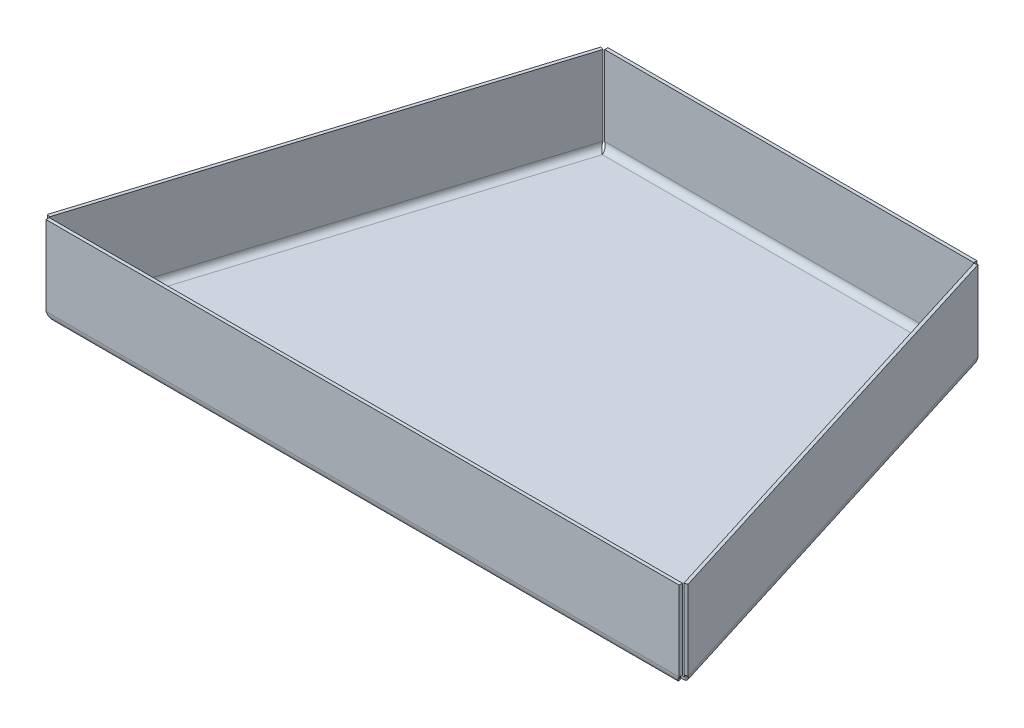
ISO-10303-21;
HEADER;
FILE_DESCRIPTION(('STEP AP214'),'2;1');
FILE_NAME('part.step','',(''),(''),'','','');
FILE_SCHEMA(('AUTOMOTIVE_DESIGN { 1 0 10303 214 1 1 1 1 }'));
ENDSEC;
DATA;
#1=APPLICATION_CONTEXT('core data for automotive mechanical design processes');
#2=APPLICATION_PROTOCOL_DEFINITION('international standard','automotive_design',2000,#1);
#3=PRODUCT_CONTEXT('',#1,'mechanical');
#4=PRODUCT('Part','Part','',(#3));
#5=PRODUCT_RELATED_PRODUCT_CATEGORY('part','',(#4));
#6=PRODUCT_DEFINITION_FORMATION('','',#4);
#7=PRODUCT_DEFINITION_CONTEXT('part definition',#1,'design');
#8=PRODUCT_DEFINITION('design','',#6,#7);
#9=PRODUCT_DEFINITION_SHAPE('','',#8);
#10=(LENGTH_UNIT() NAMED_UNIT(*) SI_UNIT(.MILLI.,.METRE.));
#11=(NAMED_UNIT(*) PLANE_ANGLE_UNIT() SI_UNIT($,.RADIAN.));
#12=(NAMED_UNIT(*) SI_UNIT($,.STERADIAN.) SOLID_ANGLE_UNIT());
#13=UNCERTAINTY_MEASURE_WITH_UNIT(LENGTH_MEASURE(1.E-05),#10,'distance_accuracy_value','');
#14=(GEOMETRIC_REPRESENTATION_CONTEXT(3) GLOBAL_UNCERTAINTY_ASSIGNED_CONTEXT((#13)) GLOBAL_UNIT_ASSIGNED_CONTEXT((#10,
#11,#12)) REPRESENTATION_CONTEXT('',''));
#15=CARTESIAN_POINT('',(0.,0.,0.));
#16=DIRECTION('',(0.,0.,1.));
#17=DIRECTION('',(1.,0.,0.));
#18=AXIS2_PLACEMENT_3D('',#15,#16,#17);
#19=CARTESIAN_POINT('',(-76.2,0.7874,0.));
#20=DIRECTION('',(0.,1.,0.));
#21=DIRECTION('',(0.,0.,1.));
#22=AXIS2_PLACEMENT_3D('',#19,#20,#21);
#23=PLANE('',#22);
#24=DIRECTION('',(-0.298274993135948,0.,0.95447997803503));
#25=VECTOR('',#24,1.);
#26=CARTESIAN_POINT('',(-74.6814208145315,0.787399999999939,0.249925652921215));
#27=LINE('',#26,#25);
#28=CARTESIAN_POINT('',(-74.1270690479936,0.7874,-1.52399999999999));
#29=VERTEX_POINT('',#28);
#30=CARTESIAN_POINT('',(-43.3295690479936,0.7874,-100.076));
#31=VERTEX_POINT('',#30);
#32=EDGE_CURVE('E514',#29,#31,#27,.F.);
#33=ORIENTED_EDGE('',*,*,#32,.F.);
#34=DIRECTION('',(1.,0.,0.));
#35=VECTOR('',#34,1.);
#36=CARTESIAN_POINT('',(75.9855948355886,0.787399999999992,-1.524));
#37=LINE('',#36,#35);
#38=CARTESIAN_POINT('',(74.1270690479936,0.7874,-1.524));
#39=VERTEX_POINT('',#38);
#40=EDGE_CURVE('E216',#39,#29,#37,.F.);
#41=ORIENTED_EDGE('',*,*,#40,.F.);
#42=DIRECTION('',(-0.298274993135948,0.,-0.95447997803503));
#43=VECTOR('',#42,1.);
#44=CARTESIAN_POINT('',(43.0423892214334,0.787400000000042,-100.994975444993));
#45=LINE('',#44,#43);
#46=CARTESIAN_POINT('',(43.3295690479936,0.7874,-100.076));
#47=VERTEX_POINT('',#46);
#48=EDGE_CURVE('E60',#47,#39,#45,.F.);
#49=ORIENTED_EDGE('',*,*,#48,.F.);
#50=DIRECTION('',(-1.,0.,0.));
#51=VECTOR('',#50,1.);
#52=CARTESIAN_POINT('',(-44.2923712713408,0.787399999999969,-100.076));
#53=LINE('',#52,#51);
#54=EDGE_CURVE('E55',#31,#47,#53,.F.);
#55=ORIENTED_EDGE('',*,*,#54,.F.);
#56=EDGE_LOOP('',(#33,#41,#49,#55));
#57=FACE_BOUND('',#56,.T.);
#58=ADVANCED_FACE('F33',(#57),#23,.T.);
#59=CARTESIAN_POINT('',(-76.2,0.,0.));
#60=DIRECTION('',(0.,1.,0.));
#61=DIRECTION('',(0.,0.,1.));
#62=AXIS2_PLACEMENT_3D('',#59,#60,#61);
#63=PLANE('',#62);
#64=DIRECTION('',(1.,0.,0.));
#65=VECTOR('',#64,1.);
#66=CARTESIAN_POINT('',(75.9855948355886,0.,-1.524));
#67=LINE('',#66,#65);
#68=CARTESIAN_POINT('',(74.1270690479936,0.,-1.524));
#69=VERTEX_POINT('',#68);
#70=CARTESIAN_POINT('',(-74.1270690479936,0.,-1.52399999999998));
#71=VERTEX_POINT('',#70);
#72=EDGE_CURVE('E220',#69,#71,#67,.F.);
#73=ORIENTED_EDGE('',*,*,#72,.T.);
#74=DIRECTION('',(-0.298274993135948,0.,0.95447997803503));
#75=VECTOR('',#74,1.);
#76=CARTESIAN_POINT('',(-74.6814208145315,0.,0.249925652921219));
#77=LINE('',#76,#75);
#78=CARTESIAN_POINT('',(-43.3295690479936,0.,-100.076));
#79=VERTEX_POINT('',#78);
#80=EDGE_CURVE('E490',#71,#79,#77,.F.);
#81=ORIENTED_EDGE('',*,*,#80,.T.);
#82=DIRECTION('',(-1.,0.,0.));
#83=VECTOR('',#82,1.);
#84=CARTESIAN_POINT('',(-44.2923712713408,0.,-100.076));
#85=LINE('',#84,#83);
#86=CARTESIAN_POINT('',(43.3295690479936,0.,-100.076));
#87=VERTEX_POINT('',#86);
#88=EDGE_CURVE('E385',#79,#87,#85,.F.);
#89=ORIENTED_EDGE('',*,*,#88,.T.);
#90=DIRECTION('',(-0.298274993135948,0.,-0.95447997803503));
#91=VECTOR('',#90,1.);
#92=CARTESIAN_POINT('',(43.0423892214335,0.,-100.994975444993));
#93=LINE('',#92,#91);
#94=EDGE_CURVE('E322',#87,#69,#93,.F.);
#95=ORIENTED_EDGE('',*,*,#94,.T.);
#96=EDGE_LOOP('',(#73,#81,#89,#95));
#97=FACE_BOUND('',#96,.T.);
#98=ADVANCED_FACE('F35',(#97),#63,.F.);
#99=CARTESIAN_POINT('',(-43.3295690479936,-0.00787400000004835,-100.076));
#100=CARTESIAN_POINT('',(-43.5954549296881,-0.00787400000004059,-100.243163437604));
#101=CARTESIAN_POINT('',(-43.8611371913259,0.0524904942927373,-100.41023490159));
#102=CARTESIAN_POINT('',(-44.3487040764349,0.284849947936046,-100.730719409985));
#103=CARTESIAN_POINT('',(-44.5703332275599,0.456753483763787,-100.884038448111));
#104=CARTESIAN_POINT('',(-44.9322704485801,0.886097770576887,-101.165263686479));
#105=CARTESIAN_POINT('',(-45.0724172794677,1.14336959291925,-101.293119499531));
#106=CARTESIAN_POINT('',(-45.2463364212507,1.7043349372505,-101.515589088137));
#107=CARTESIAN_POINT('',(-45.2800255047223,2.00775657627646,-101.610162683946));
#108=CARTESIAN_POINT('',(-45.2560898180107,2.31139999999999,-101.686756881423));
#109=CARTESIAN_POINT('',(-43.3295690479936,0.,-100.076));
#110=CARTESIAN_POINT('',(-43.5944709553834,0.,-100.242855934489));
#111=CARTESIAN_POINT('',(-43.8591700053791,0.0601595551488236,-100.409620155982));
#112=CARTESIAN_POINT('',(-44.3449190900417,0.291730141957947,-100.729536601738));
#113=CARTESIAN_POINT('',(-44.5657145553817,0.46305006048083,-100.882595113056));
#114=CARTESIAN_POINT('',(-44.9262604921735,0.89093671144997,-101.163385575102));
#115=CARTESIAN_POINT('',(-45.0658502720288,1.14733508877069,-101.291067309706));
#116=CARTESIAN_POINT('',(-45.2390164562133,1.70639594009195,-101.513301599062));
#117=CARTESIAN_POINT('',(-45.2725099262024,2.00878748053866,-101.607814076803));
#118=CARTESIAN_POINT('',(-45.2485742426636,2.31139999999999,-101.684408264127));
#119=CARTESIAN_POINT('',(-43.3295690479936,0.787399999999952,-100.076));
#120=CARTESIAN_POINT('',(-43.4960735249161,0.787399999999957,-100.212105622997));
#121=CARTESIAN_POINT('',(-43.6624514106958,0.82706564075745,-100.348145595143));
#122=CARTESIAN_POINT('',(-43.9664204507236,0.979749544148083,-100.611255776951));
#123=CARTESIAN_POINT('',(-44.1038473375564,1.09270773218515,-100.738261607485));
#124=CARTESIAN_POINT('',(-44.3252648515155,1.37483079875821,-100.975574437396));
#125=CARTESIAN_POINT('',(-44.4091495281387,1.54388467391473,-101.08584832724));
#126=CARTESIAN_POINT('',(-44.5070199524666,1.91249622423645,-101.284552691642));
#127=CARTESIAN_POINT('',(-44.5209520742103,2.11187790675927,-101.372953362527));
#128=CARTESIAN_POINT('',(-44.4970167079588,2.31139999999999,-101.449546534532));
#129=CARTESIAN_POINT('',(-43.3295690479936,0.795352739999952,-100.076));
#130=CARTESIAN_POINT('',(-43.4950797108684,0.795352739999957,-100.211795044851));
#131=CARTESIAN_POINT('',(-43.6604645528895,0.834811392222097,-100.347524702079));
#132=CARTESIAN_POINT('',(-43.9625976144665,0.986698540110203,-100.61006114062));
#133=CARTESIAN_POINT('',(-44.0991824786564,1.09906727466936,-100.736803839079));
#134=CARTESIAN_POINT('',(-44.3191947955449,1.37971812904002,-100.973677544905));
#135=CARTESIAN_POINT('',(-44.4025168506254,1.54788982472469,-101.083775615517));
#136=CARTESIAN_POINT('',(-44.4996267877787,1.9145778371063,-101.282242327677));
#137=CARTESIAN_POINT('',(-44.5133613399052,2.11291912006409,-101.370581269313));
#138=CARTESIAN_POINT('',(-44.4894259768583,2.31139999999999,-101.447174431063));
#139=B_SPLINE_SURFACE_WITH_KNOTS('',1,3,((#99,#100,#101,#102,#103,#104,#105,#106,#107,#108),
(#109,#110,#111,#112,#113,#114,#115,#116,#117,#118),(#119,#120,#121,#122,#123,#124,#125,#126,
#127,#128),(#129,#130,#131,#132,#133,#134,#135,#136,#137,#138)),.UNSPECIFIED.,.F.,.F.,.F.,(2,1,
1,2),(4,2,2,2,4),(-0.01,0.,1.,1.0101),(0.,0.25,0.5,0.75,1.),.UNSPECIFIED.);
#140=DIRECTION('',(0.954479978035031,0.,0.298274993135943));
#141=VECTOR('',#140,1.);
#142=CARTESIAN_POINT('',(-44.4970167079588,2.31139999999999,-101.449546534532));
#143=LINE('',#142,#141);
#144=CARTESIAN_POINT('',(-45.2485742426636,2.31139999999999,-101.684408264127));
#145=VERTEX_POINT('',#144);
#146=CARTESIAN_POINT('',(-44.4970167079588,2.31139999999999,-101.449546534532));
#147=VERTEX_POINT('',#146);
#148=EDGE_CURVE('E549',#145,#147,#143,.T.);
#149=CARTESIAN_POINT('',(-43.3295690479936,0.787399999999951,-100.076));
#150=CARTESIAN_POINT('',(-43.3681453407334,0.787399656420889,-100.107535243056));
#151=CARTESIAN_POINT('',(-43.4067038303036,0.789504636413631,-100.139054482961));
#152=CARTESIAN_POINT('',(-43.4834549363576,0.797898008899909,-100.201976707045));
#153=CARTESIAN_POINT('',(-43.5216475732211,0.804186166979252,-100.233379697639));
#154=CARTESIAN_POINT('',(-43.6350593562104,0.829256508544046,-100.327186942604));
#155=CARTESIAN_POINT('',(-43.7092455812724,0.854244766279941,-100.3892971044));
#156=CARTESIAN_POINT('',(-43.8519224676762,0.919977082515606,-100.511752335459));
#157=CARTESIAN_POINT('',(-43.9204082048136,0.96073459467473,-100.572095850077));
#158=CARTESIAN_POINT('',(-44.049021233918,1.05665098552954,-100.690161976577));
#159=CARTESIAN_POINT('',(-44.1091509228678,1.11180572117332,-100.747885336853));
#160=CARTESIAN_POINT('',(-44.2187029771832,1.23469176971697,-100.859984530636));
#161=CARTESIAN_POINT('',(-44.2681263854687,1.30242185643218,-100.91436068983));
#162=CARTESIAN_POINT('',(-44.3543064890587,1.44827270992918,-101.019170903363));
#163=CARTESIAN_POINT('',(-44.3910570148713,1.5263985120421,-101.069603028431));
#164=CARTESIAN_POINT('',(-44.4502904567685,1.69045477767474,-101.166027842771));
#165=CARTESIAN_POINT('',(-44.4727656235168,1.77638945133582,-101.212018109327));
#166=CARTESIAN_POINT('',(-44.5022818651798,1.95313519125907,-101.299136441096));
#167=CARTESIAN_POINT('',(-44.5093471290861,2.04393838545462,-101.340272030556));
#168=CARTESIAN_POINT('',(-44.5081555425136,2.16479056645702,-101.391166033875));
#169=CARTESIAN_POINT('',(-44.5070584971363,2.19407965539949,-101.403206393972));
#170=CARTESIAN_POINT('',(-44.503247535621,2.25270852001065,-101.42676195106));
#171=CARTESIAN_POINT('',(-44.5005362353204,2.28204813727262,-101.438277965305));
#172=CARTESIAN_POINT('',(-44.4970167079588,2.31139999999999,-101.449546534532));
#173=B_SPLINE_CURVE_WITH_KNOTS('',3,(#149,#150,#151,#152,#153,#154,#155,#156,#157,#158,#159,
#160,#161,#162,#163,#164,#165,#166,#167,#168,#169,#170,#171,#172),.UNSPECIFIED.,.F.,.F.,(4,2,2,
2,2,2,2,2,2,2,2,4),(0.,0.149385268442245,0.298762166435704,0.597008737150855,0.89551032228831,
1.19392610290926,1.49231280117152,1.79084455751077,2.08953823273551,2.38776270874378,
2.4827895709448,2.5776628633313),.UNSPECIFIED.);
#174=EDGE_CURVE('E491',#31,#147,#173,.T.);
#175=DIRECTION('',(0.,-1.,0.));
#176=VECTOR('',#175,1.);
#177=CARTESIAN_POINT('',(-43.3295690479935,0.787399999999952,-100.076));
#178=LINE('',#177,#176);
#179=EDGE_CURVE('E11',#31,#79,#178,.T.);
#180=CARTESIAN_POINT('',(-43.3295690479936,0.,-100.076));
#181=CARTESIAN_POINT('',(-43.3866053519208,-1.75952508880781E-07,-100.111927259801));
#182=CARTESIAN_POINT('',(-43.4436169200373,0.0027566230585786,-100.147838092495));
#183=CARTESIAN_POINT('',(-43.5571928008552,0.0137538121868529,-100.219517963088));
#184=CARTESIAN_POINT('',(-43.6137571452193,0.0219938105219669,-100.255287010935));
#185=CARTESIAN_POINT('',(-43.7820467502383,0.0548647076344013,-100.362131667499));
#186=CARTESIAN_POINT('',(-43.8925212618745,0.0876466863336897,-100.432840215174));
#187=CARTESIAN_POINT('',(-44.1099638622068,0.175442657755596,-100.57434296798));
#188=CARTESIAN_POINT('',(-44.2166969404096,0.231152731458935,-100.645063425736));
#189=CARTESIAN_POINT('',(-44.4191417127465,0.36307644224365,-100.783052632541));
#190=CARTESIAN_POINT('',(-44.5148551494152,0.439286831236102,-100.850321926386));
#191=CARTESIAN_POINT('',(-44.6920250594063,0.609891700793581,-100.980408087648));
#192=CARTESIAN_POINT('',(-44.7734821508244,0.704285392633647,-101.043225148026));
#193=CARTESIAN_POINT('',(-44.9193754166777,0.908427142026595,-101.163546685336));
#194=CARTESIAN_POINT('',(-44.9838069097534,1.0181794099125,-101.221049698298));
#195=CARTESIAN_POINT('',(-45.0933492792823,1.24969461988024,-101.330029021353));
#196=CARTESIAN_POINT('',(-45.1384541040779,1.37146130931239,-101.381503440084));
#197=CARTESIAN_POINT('',(-45.2075897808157,1.62324236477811,-101.477848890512));
#198=CARTESIAN_POINT('',(-45.2316396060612,1.75324919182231,-101.522725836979));
#199=CARTESIAN_POINT('',(-45.251590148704,1.95558424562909,-101.586154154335));
#200=CARTESIAN_POINT('',(-45.2553958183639,2.02644664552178,-101.607200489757));
#201=CARTESIAN_POINT('',(-45.256706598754,2.16866214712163,-101.647291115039));
#202=CARTESIAN_POINT('',(-45.2542225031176,2.24001419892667,-101.666338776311));
#203=CARTESIAN_POINT('',(-45.2485742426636,2.31139999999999,-101.684408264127));
#204=B_SPLINE_CURVE_WITH_KNOTS('',3,(#180,#181,#182,#183,#184,#185,#186,#187,#188,#189,#190,
#191,#192,#193,#194,#195,#196,#197,#198,#199,#200,#201,#202,#203),.UNSPECIFIED.,.F.,.F.,(4,2,2,
2,2,2,2,2,2,2,2,4),(0.,0.202110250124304,0.404206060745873,0.8078640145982,1.2248049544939,
1.64167987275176,2.0585367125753,2.47550805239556,2.89260986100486,3.30933541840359,
3.53113244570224,3.75254911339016),.UNSPECIFIED.);
#205=EDGE_CURVE('E479',#79,#145,#204,.T.);
#206=ORIENTED_EDGE('',*,*,#148,.T.);
#207=ORIENTED_EDGE('',*,*,#174,.F.);
#208=ORIENTED_EDGE('',*,*,#179,.T.);
#209=ORIENTED_EDGE('',*,*,#205,.T.);
#210=EDGE_LOOP('',(#206,#207,#208,#209));
#211=FACE_BOUND('',#210,.T.);
#212=ADVANCED_FACE('F474',(#211),#139,.F.);
#213=CARTESIAN_POINT('',(-76.8951214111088,2.31139999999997,-0.441855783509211));
#214=CARTESIAN_POINT('',(-76.8489188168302,2.00776431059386,-0.589704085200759));
#215=CARTESIAN_POINT('',(-76.7451127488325,1.70433493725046,-0.719504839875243));
#216=CARTESIAN_POINT('',(-76.4309383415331,1.1433695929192,-0.945852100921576));
#217=CARTESIAN_POINT('',(-76.2206638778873,0.886097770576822,-1.04240471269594));
#218=CARTESIAN_POINT('',(-75.7184713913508,0.456753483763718,-1.20999632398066));
#219=CARTESIAN_POINT('',(-75.4267146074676,0.284849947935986,-1.28108571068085));
#220=CARTESIAN_POINT('',(-74.7988924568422,0.0524904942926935,-1.4094180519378));
#221=CARTESIAN_POINT('',(-74.4630858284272,-0.00787400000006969,-1.46671863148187));
#222=CARTESIAN_POINT('',(-74.1270690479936,-0.00787400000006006,-1.52399999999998));
#223=CARTESIAN_POINT('',(-76.8876058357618,2.31139999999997,-0.439507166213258));
#224=CARTESIAN_POINT('',(-76.8414032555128,2.00879522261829,-0.587355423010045));
#225=CARTESIAN_POINT('',(-76.737792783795,1.70639594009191,-0.717217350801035));
#226=CARTESIAN_POINT('',(-76.4243713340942,1.14733508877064,-0.94379991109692));
#227=CARTESIAN_POINT('',(-76.2146539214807,0.890936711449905,-1.04052660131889));
#228=CARTESIAN_POINT('',(-75.7138527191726,0.463050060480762,-1.20855298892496));
#229=CARTESIAN_POINT('',(-75.4229296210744,0.291730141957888,-1.27990290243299));
#230=CARTESIAN_POINT('',(-74.7969252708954,0.0601595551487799,-1.40880330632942));
#231=CARTESIAN_POINT('',(-74.4621018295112,0.,-1.46641118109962));
#232=CARTESIAN_POINT('',(-74.1270690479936,0.,-1.52399999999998));
#233=CARTESIAN_POINT('',(-76.136048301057,2.31139999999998,-0.204645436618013));
#234=CARTESIAN_POINT('',(-76.0898471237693,2.11188642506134,-0.352489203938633));
#235=CARTESIAN_POINT('',(-76.0057962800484,1.91249622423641,-0.488468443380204));
#236=CARTESIAN_POINT('',(-75.7676705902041,1.54388467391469,-0.738580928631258));
#237=CARTESIAN_POINT('',(-75.6136582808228,1.37483079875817,-0.852715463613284));
#238=CARTESIAN_POINT('',(-75.2519855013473,1.0927077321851,-1.06421948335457));
#239=CARTESIAN_POINT('',(-75.0444309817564,0.979749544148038,-1.16162207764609));
#240=CARTESIAN_POINT('',(-74.6002066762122,0.827065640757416,-1.34732874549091));
#241=CARTESIAN_POINT('',(-74.3637019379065,0.787399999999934,-1.43566614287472));
#242=CARTESIAN_POINT('',(-74.1270690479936,0.78739999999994,-1.52399999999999));
#243=CARTESIAN_POINT('',(-76.1284575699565,2.31139999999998,-0.202273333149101));
#244=CARTESIAN_POINT('',(-76.0822564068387,2.11292764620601,-0.350117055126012));
#245=CARTESIAN_POINT('',(-75.9984031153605,1.91457783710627,-0.486158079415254));
#246=CARTESIAN_POINT('',(-75.7610379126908,1.54788982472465,-0.736508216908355));
#247=CARTESIAN_POINT('',(-75.6075882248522,1.37971812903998,-0.850818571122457));
#248=CARTESIAN_POINT('',(-75.2473206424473,1.09906727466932,-1.06276171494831));
#249=CARTESIAN_POINT('',(-75.0406081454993,0.986698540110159,-1.16042744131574));
#250=CARTESIAN_POINT('',(-74.5982198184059,0.834811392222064,-1.34670785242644));
#251=CARTESIAN_POINT('',(-74.3627080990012,0.795352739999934,-1.43535561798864));
#252=CARTESIAN_POINT('',(-74.1270690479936,0.79535273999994,-1.52399999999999));
#253=B_SPLINE_SURFACE_WITH_KNOTS('',1,3,((#213,#214,#215,#216,#217,#218,#219,#220,#221,#222),
(#223,#224,#225,#226,#227,#228,#229,#230,#231,#232),(#233,#234,#235,#236,#237,#238,#239,#240,
#241,#242),(#243,#244,#245,#246,#247,#248,#249,#250,#251,#252)),.UNSPECIFIED.,.F.,.F.,.F.,(2,1,
1,2),(4,2,2,2,4),(-0.01,0.,1.,1.0101),(0.,0.25,0.5,0.75,1.),.UNSPECIFIED.);
#254=CARTESIAN_POINT('',(-76.136048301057,2.31139999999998,-0.204645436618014));
#255=CARTESIAN_POINT('',(-76.1235954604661,2.25758361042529,-0.244530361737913));
#256=CARTESIAN_POINT('',(-76.1084025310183,2.20376928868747,-0.28355560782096));
#257=CARTESIAN_POINT('',(-76.0726124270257,2.09674605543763,-0.359912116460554));
#258=CARTESIAN_POINT('',(-76.0520156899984,2.04353709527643,-0.397243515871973));
#259=CARTESIAN_POINT('',(-76.0055115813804,1.93836154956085,-0.470213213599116));
#260=CARTESIAN_POINT('',(-75.9796087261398,1.88639394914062,-0.505852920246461));
#261=CARTESIAN_POINT('',(-75.9226528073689,1.78425124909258,-0.575512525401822));
#262=CARTESIAN_POINT('',(-75.8915997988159,1.73407613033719,-0.609532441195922));
#263=CARTESIAN_POINT('',(-75.7902577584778,1.5860114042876,-0.709978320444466));
#264=CARTESIAN_POINT('',(-75.7122577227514,1.49166017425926,-0.774060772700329));
#265=CARTESIAN_POINT('',(-75.5384038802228,1.3169486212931,-0.896575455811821));
#266=CARTESIAN_POINT('',(-75.4425561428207,1.23658356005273,-0.955009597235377));
#267=CARTESIAN_POINT('',(-75.2361583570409,1.0933708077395,-1.06730596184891));
#268=CARTESIAN_POINT('',(-75.1256043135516,1.03052789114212,-1.12116693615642));
#269=CARTESIAN_POINT('',(-74.8936825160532,0.925278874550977,-1.22553310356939));
#270=CARTESIAN_POINT('',(-74.7723159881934,0.882870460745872,-1.27603867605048));
#271=CARTESIAN_POINT('',(-74.5629316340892,0.830362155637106,-1.35924602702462));
#272=CARTESIAN_POINT('',(-74.4765846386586,0.814276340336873,-1.39250122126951));
#273=CARTESIAN_POINT('',(-74.3025268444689,0.792788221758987,-1.45849843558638));
#274=CARTESIAN_POINT('',(-74.2148182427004,0.787370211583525,-1.4912411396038));
#275=CARTESIAN_POINT('',(-74.1270690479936,0.78739999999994,-1.52399999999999));
#276=B_SPLINE_CURVE_WITH_KNOTS('',3,(#254,#255,#256,#257,#258,#259,#260,#261,#262,#263,#264,
#265,#266,#267,#268,#269,#270,#271,#272,#273,#274,#275),.UNSPECIFIED.,.F.,.F.,(4,2,2,2,2,2,2,2,
2,2,4),(0.,0.204332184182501,0.408647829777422,0.6127902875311,0.816930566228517,
1.22931246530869,1.64155438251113,2.05390851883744,2.46621595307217,2.7473847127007,
3.02813917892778),.UNSPECIFIED.);
#277=CARTESIAN_POINT('',(-76.136048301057,2.31139999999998,-0.204645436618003));
#278=VERTEX_POINT('',#277);
#279=EDGE_CURVE('E37',#278,#29,#276,.T.);
#280=DIRECTION('',(0.95447997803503,0.,0.298274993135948));
#281=VECTOR('',#280,1.);
#282=CARTESIAN_POINT('',(-76.1360483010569,2.31139999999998,-0.204645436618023));
#283=LINE('',#282,#281);
#284=CARTESIAN_POINT('',(-76.8876058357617,2.31139999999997,-0.439507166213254));
#285=VERTEX_POINT('',#284);
#286=EDGE_CURVE('E530',#285,#278,#283,.T.);
#287=CARTESIAN_POINT('',(-76.8876058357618,2.31139999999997,-0.439507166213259));
#288=CARTESIAN_POINT('',(-76.8764573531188,2.23832318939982,-0.475216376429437));
#289=CARTESIAN_POINT('',(-76.8619824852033,2.16524965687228,-0.509883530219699));
#290=CARTESIAN_POINT('',(-76.8264535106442,2.01976210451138,-0.577157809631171));
#291=CARTESIAN_POINT('',(-76.8053998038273,1.94734804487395,-0.609765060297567));
#292=CARTESIAN_POINT('',(-76.7568053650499,1.80388256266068,-0.672921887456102));
#293=CARTESIAN_POINT('',(-76.729269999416,1.73283006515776,-0.703473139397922));
#294=CARTESIAN_POINT('',(-76.6678714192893,1.59268720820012,-0.762590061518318));
#295=CARTESIAN_POINT('',(-76.6340083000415,1.52359681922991,-0.791155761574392));
#296=CARTESIAN_POINT('',(-76.5231272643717,1.32007275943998,-0.874009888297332));
#297=CARTESIAN_POINT('',(-76.4368187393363,1.18938936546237,-0.925453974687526));
#298=CARTESIAN_POINT('',(-76.2419097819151,0.943125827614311,-1.02130197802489));
#299=CARTESIAN_POINT('',(-76.1333175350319,0.827540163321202,-1.06570846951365));
#300=CARTESIAN_POINT('',(-75.8968864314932,0.615478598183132,-1.14851217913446));
#301=CARTESIAN_POINT('',(-75.7690506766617,0.518999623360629,-1.18691036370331));
#302=CARTESIAN_POINT('',(-75.4978476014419,0.348553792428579,-1.25888799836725));
#303=CARTESIAN_POINT('',(-75.3544695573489,0.274602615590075,-1.29246408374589));
#304=CARTESIAN_POINT('',(-75.0563664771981,0.151892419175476,-1.35618386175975));
#305=CARTESIAN_POINT('',(-74.9016325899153,0.103153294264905,-1.38632482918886));
#306=CARTESIAN_POINT('',(-74.6650742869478,0.0503716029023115,-1.4299658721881));
#307=CARTESIAN_POINT('',(-74.585526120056,0.0361678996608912,-1.44424331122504));
#308=CARTESIAN_POINT('',(-74.4254623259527,0.0146025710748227,-1.47249538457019));
#309=CARTESIAN_POINT('',(-74.3449471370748,0.00723795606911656,-1.48647014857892));
#310=CARTESIAN_POINT('',(-74.2185676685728,0.0011065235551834,-1.50827123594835));
#311=CARTESIAN_POINT('',(-74.1728136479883,-3.51655148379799E-06,-1.51613659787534));
#312=CARTESIAN_POINT('',(-74.1270690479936,0.,-1.52399999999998));
#313=B_SPLINE_CURVE_WITH_KNOTS('',3,(#287,#288,#289,#290,#291,#292,#293,#294,#295,#296,#297,
#298,#299,#300,#301,#302,#303,#304,#305,#306,#307,#308,#309,#310,#311,#312),.UNSPECIFIED.,.F.,
.F.,(4,2,2,2,2,2,2,2,2,2,2,2,4),(0.,0.246205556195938,0.492396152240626,0.738383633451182,
0.984367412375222,1.47634567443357,1.96814354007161,2.45986221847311,2.95192235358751,
3.44437018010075,3.69030845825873,3.9361391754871,4.07539645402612),.UNSPECIFIED.);
#314=EDGE_CURVE('E485',#285,#71,#313,.T.);
#315=DIRECTION('',(0.,-1.,0.));
#316=VECTOR('',#315,1.);
#317=CARTESIAN_POINT('',(-74.1270690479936,0.78739999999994,-1.52399999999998));
#318=LINE('',#317,#316);
#319=EDGE_CURVE('E47',#29,#71,#318,.T.);
#320=ORIENTED_EDGE('',*,*,#279,.F.);
#321=ORIENTED_EDGE('',*,*,#286,.F.);
#322=ORIENTED_EDGE('',*,*,#314,.T.);
#323=ORIENTED_EDGE('',*,*,#319,.F.);
#324=EDGE_LOOP('',(#320,#321,#322,#323));
#325=FACE_BOUND('',#324,.T.);
#326=ADVANCED_FACE('F472',(#325),#253,.F.);
#327=CARTESIAN_POINT('',(-74.6814208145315,2.31139999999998,0.249925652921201));
#328=DIRECTION('',(-0.298274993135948,0.,0.95447997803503));
#329=DIRECTION('',(-0.95447997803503,0.,-0.298274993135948));
#330=AXIS2_PLACEMENT_3D('',#327,#328,#329);
#331=CYLINDRICAL_SURFACE('',#330,2.31140000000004);
#332=ORIENTED_EDGE('',*,*,#80,.F.);
#333=ORIENTED_EDGE('',*,*,#314,.F.);
#334=DIRECTION('',(0.298274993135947,0.,-0.95447997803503));
#335=VECTOR('',#334,1.);
#336=CARTESIAN_POINT('',(-45.2015575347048,2.31139999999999,-101.834861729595));
#337=LINE('',#336,#335);
#338=EDGE_CURVE('E554',#285,#145,#337,.T.);
#339=ORIENTED_EDGE('',*,*,#338,.T.);
#340=ORIENTED_EDGE('',*,*,#205,.F.);
#341=EDGE_LOOP('',(#332,#333,#339,#340));
#342=FACE_BOUND('',#341,.T.);
#343=ADVANCED_FACE('F469',(#342),#331,.T.);
#344=CARTESIAN_POINT('',(-74.6814208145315,2.31139999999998,0.249925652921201));
#345=DIRECTION('',(-0.298274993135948,0.,0.95447997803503));
#346=DIRECTION('',(-0.95447997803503,0.,-0.298274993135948));
#347=AXIS2_PLACEMENT_3D('',#344,#345,#346);
#348=CYLINDRICAL_SURFACE('',#347,1.52400000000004);
#349=ORIENTED_EDGE('',*,*,#32,.T.);
#350=ORIENTED_EDGE('',*,*,#174,.T.);
#351=DIRECTION('',(-0.298274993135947,0.,0.95447997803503));
#352=VECTOR('',#351,1.);
#353=CARTESIAN_POINT('',(-44.45,2.31139999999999,-101.6));
#354=LINE('',#353,#352);
#355=EDGE_CURVE('E529',#147,#278,#354,.T.);
#356=ORIENTED_EDGE('',*,*,#355,.T.);
#357=ORIENTED_EDGE('',*,*,#279,.T.);
#358=EDGE_LOOP('',(#349,#350,#356,#357));
#359=FACE_BOUND('',#358,.T.);
#360=ADVANCED_FACE('F457',(#359),#348,.F.);
#361=CARTESIAN_POINT('',(-44.4970167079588,0.7874,-101.449546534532));
#362=DIRECTION('',(0.298274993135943,0.,-0.954479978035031));
#363=DIRECTION('',(-0.954479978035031,0.,-0.298274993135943));
#364=AXIS2_PLACEMENT_3D('',#361,#362,#363);
#365=PLANE('',#364);
#366=DIRECTION('',(0.,1.,0.));
#367=VECTOR('',#366,1.);
#368=CARTESIAN_POINT('',(-45.2485742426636,0.787399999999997,-101.684408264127));
#369=LINE('',#368,#367);
#370=CARTESIAN_POINT('',(-45.2485742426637,21.4122,-101.684408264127));
#371=VERTEX_POINT('',#370);
#372=EDGE_CURVE('E561',#145,#371,#369,.T.);
#373=ORIENTED_EDGE('',*,*,#372,.T.);
#374=DIRECTION('',(0.954479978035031,0.,0.298274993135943));
#375=VECTOR('',#374,1.);
#376=CARTESIAN_POINT('',(-45.2485742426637,21.4122,-101.684408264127));
#377=LINE('',#376,#375);
#378=CARTESIAN_POINT('',(-44.4970167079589,21.4122,-101.449546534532));
#379=VERTEX_POINT('',#378);
#380=EDGE_CURVE('E558',#371,#379,#377,.T.);
#381=ORIENTED_EDGE('',*,*,#380,.T.);
#382=DIRECTION('',(0.,1.,0.));
#383=VECTOR('',#382,1.);
#384=CARTESIAN_POINT('',(-44.4970167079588,0.7874,-101.449546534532));
#385=LINE('',#384,#383);
#386=EDGE_CURVE('E564',#147,#379,#385,.T.);
#387=ORIENTED_EDGE('',*,*,#386,.F.);
#388=ORIENTED_EDGE('',*,*,#148,.F.);
#389=EDGE_LOOP('',(#373,#381,#387,#388));
#390=FACE_BOUND('',#389,.T.);
#391=ADVANCED_FACE('F453',(#390),#365,.T.);
#392=CARTESIAN_POINT('',(-45.2015575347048,0.787399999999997,-101.834861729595));
#393=DIRECTION('',(0.95447997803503,0.,0.298274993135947));
#394=DIRECTION('',(0.298274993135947,0.,-0.95447997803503));
#395=AXIS2_PLACEMENT_3D('',#392,#393,#394);
#396=PLANE('',#395);
#397=ORIENTED_EDGE('',*,*,#338,.F.);
#398=DIRECTION('',(0.,1.,0.));
#399=VECTOR('',#398,1.);
#400=CARTESIAN_POINT('',(-76.8876058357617,0.787399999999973,-0.439507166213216));
#401=LINE('',#400,#399);
#402=CARTESIAN_POINT('',(-76.8876058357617,21.4122,-0.43950716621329));
#403=VERTEX_POINT('',#402);
#404=EDGE_CURVE('E568',#285,#403,#401,.T.);
#405=ORIENTED_EDGE('',*,*,#404,.T.);
#406=DIRECTION('',(0.298274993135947,0.,-0.95447997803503));
#407=VECTOR('',#406,1.);
#408=CARTESIAN_POINT('',(-45.2015575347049,21.4122,-101.834861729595));
#409=LINE('',#408,#407);
#410=EDGE_CURVE('E551',#403,#371,#409,.T.);
#411=ORIENTED_EDGE('',*,*,#410,.T.);
#412=ORIENTED_EDGE('',*,*,#372,.F.);
#413=EDGE_LOOP('',(#397,#405,#411,#412));
#414=FACE_BOUND('',#413,.T.);
#415=ADVANCED_FACE('F456',(#414),#396,.F.);
#416=CARTESIAN_POINT('',(-44.45,0.7874,-101.6));
#417=DIRECTION('',(0.95447997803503,0.,0.298274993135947));
#418=DIRECTION('',(0.298274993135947,0.,-0.95447997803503));
#419=AXIS2_PLACEMENT_3D('',#416,#417,#418);
#420=PLANE('',#419);
#421=DIRECTION('',(0.,1.,0.));
#422=VECTOR('',#421,1.);
#423=CARTESIAN_POINT('',(-76.1360483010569,0.7874,-0.204645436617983));
#424=LINE('',#423,#422);
#425=CARTESIAN_POINT('',(-76.1360483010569,21.4122,-0.204645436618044));
#426=VERTEX_POINT('',#425);
#427=EDGE_CURVE('E393',#278,#426,#424,.T.);
#428=ORIENTED_EDGE('',*,*,#427,.F.);
#429=ORIENTED_EDGE('',*,*,#355,.F.);
#430=ORIENTED_EDGE('',*,*,#386,.T.);
#431=DIRECTION('',(0.298274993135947,0.,-0.95447997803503));
#432=VECTOR('',#431,1.);
#433=CARTESIAN_POINT('',(-44.4500000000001,21.4122,-101.6));
#434=LINE('',#433,#432);
#435=EDGE_CURVE('E552',#426,#379,#434,.T.);
#436=ORIENTED_EDGE('',*,*,#435,.F.);
#437=EDGE_LOOP('',(#428,#429,#430,#436));
#438=FACE_BOUND('',#437,.T.);
#439=ADVANCED_FACE('F461',(#438),#420,.T.);
#440=CARTESIAN_POINT('',(-45.2015575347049,21.4122,-101.834861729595));
#441=DIRECTION('',(0.,-1.,0.));
#442=DIRECTION('',(1.,0.,0.));
#443=AXIS2_PLACEMENT_3D('',#440,#441,#442);
#444=PLANE('',#443);
#445=ORIENTED_EDGE('',*,*,#410,.F.);
#446=DIRECTION('',(0.95447997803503,0.,0.298274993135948));
#447=VECTOR('',#446,1.);
#448=CARTESIAN_POINT('',(-76.8876058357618,21.4122,-0.439507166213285));
#449=LINE('',#448,#447);
#450=EDGE_CURVE('E567',#403,#426,#449,.T.);
#451=ORIENTED_EDGE('',*,*,#450,.T.);
#452=ORIENTED_EDGE('',*,*,#435,.T.);
#453=ORIENTED_EDGE('',*,*,#380,.F.);
#454=EDGE_LOOP('',(#445,#451,#452,#453));
#455=FACE_BOUND('',#454,.T.);
#456=ADVANCED_FACE('F451',(#455),#444,.F.);
#457=CARTESIAN_POINT('',(-76.1360483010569,0.7874,-0.204645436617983));
#458=DIRECTION('',(0.298274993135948,0.,-0.95447997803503));
#459=DIRECTION('',(-0.95447997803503,0.,-0.298274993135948));
#460=AXIS2_PLACEMENT_3D('',#457,#458,#459);
#461=PLANE('',#460);
#462=ORIENTED_EDGE('',*,*,#450,.F.);
#463=ORIENTED_EDGE('',*,*,#404,.F.);
#464=ORIENTED_EDGE('',*,*,#286,.T.);
#465=ORIENTED_EDGE('',*,*,#427,.T.);
#466=EDGE_LOOP('',(#462,#463,#464,#465));
#467=FACE_BOUND('',#466,.T.);
#468=ADVANCED_FACE('F442',(#467),#461,.F.);
#469=CARTESIAN_POINT('',(43.3295690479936,-0.00787400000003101,-100.076));
#470=CARTESIAN_POINT('',(43.409816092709,-0.007874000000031,-100.379643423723));
#471=CARTESIAN_POINT('',(43.4900360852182,0.0524904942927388,-100.683065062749));
#472=CARTESIAN_POINT('',(43.6505031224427,0.28484994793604,-101.244030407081));
#473=CARTESIAN_POINT('',(43.730736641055,0.456753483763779,-101.501302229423));
#474=CARTESIAN_POINT('',(43.8912036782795,0.88609777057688,-101.930646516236));
#475=CARTESIAN_POINT('',(43.9714371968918,1.14336959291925,-102.102550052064));
#476=CARTESIAN_POINT('',(44.1319042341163,1.70433493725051,-102.334909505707));
#477=CARTESIAN_POINT('',(44.2121242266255,2.00775657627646,-102.395274));
#478=CARTESIAN_POINT('',(44.2923712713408,2.3114,-102.395274));
#479=CARTESIAN_POINT('',(43.3295690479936,0.,-100.076));
#480=CARTESIAN_POINT('',(43.4098160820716,0.,-100.378612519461));
#481=CARTESIAN_POINT('',(43.4900360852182,0.0601595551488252,-100.681004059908));
#482=CARTESIAN_POINT('',(43.6505031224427,0.291730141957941,-101.240064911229));
#483=CARTESIAN_POINT('',(43.730736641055,0.463050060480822,-101.49646328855));
#484=CARTESIAN_POINT('',(43.8912036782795,0.890936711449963,-101.924349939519));
#485=CARTESIAN_POINT('',(43.9714371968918,1.14733508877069,-102.095669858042));
#486=CARTESIAN_POINT('',(44.1319042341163,1.70639594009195,-102.327240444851));
#487=CARTESIAN_POINT('',(44.2121242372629,2.00878748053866,-102.3874));
#488=CARTESIAN_POINT('',(44.2923712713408,2.3114,-102.3874));
#489=CARTESIAN_POINT('',(43.3295690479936,0.787399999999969,-100.076));
#490=CARTESIAN_POINT('',(43.4098150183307,0.787399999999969,-100.275522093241));
#491=CARTESIAN_POINT('',(43.4900360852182,0.827065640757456,-100.474903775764));
#492=CARTESIAN_POINT('',(43.6505031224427,0.979749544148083,-100.843515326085));
#493=CARTESIAN_POINT('',(43.730736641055,1.09270773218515,-101.012569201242));
#494=CARTESIAN_POINT('',(43.8912036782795,1.37483079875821,-101.294692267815));
#495=CARTESIAN_POINT('',(43.9714371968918,1.54388467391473,-101.407650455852));
#496=CARTESIAN_POINT('',(44.1319042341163,1.91249622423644,-101.560334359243));
#497=CARTESIAN_POINT('',(44.2121253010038,2.11187790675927,-101.6));
#498=CARTESIAN_POINT('',(44.2923712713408,2.31139999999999,-101.6));
#499=CARTESIAN_POINT('',(43.3295690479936,0.795352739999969,-100.076));
#500=CARTESIAN_POINT('',(43.4098150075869,0.795352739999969,-100.274480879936));
#501=CARTESIAN_POINT('',(43.4900360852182,0.834811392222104,-100.472822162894));
#502=CARTESIAN_POINT('',(43.6505031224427,0.986698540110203,-100.839510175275));
#503=CARTESIAN_POINT('',(43.730736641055,1.09906727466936,-101.00768187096));
#504=CARTESIAN_POINT('',(43.8912036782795,1.37971812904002,-101.288332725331));
#505=CARTESIAN_POINT('',(43.9714371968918,1.54788982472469,-101.40070145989));
#506=CARTESIAN_POINT('',(44.1319042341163,1.9145778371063,-101.552588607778));
#507=CARTESIAN_POINT('',(44.2121253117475,2.1129191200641,-101.59204726));
#508=CARTESIAN_POINT('',(44.2923712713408,2.31139999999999,-101.59204726));
#509=B_SPLINE_SURFACE_WITH_KNOTS('',1,3,((#469,#470,#471,#472,#473,#474,#475,#476,#477,#478),
(#479,#480,#481,#482,#483,#484,#485,#486,#487,#488),(#489,#490,#491,#492,#493,#494,#495,#496,
#497,#498),(#499,#500,#501,#502,#503,#504,#505,#506,#507,#508)),.UNSPECIFIED.,.F.,.F.,.F.,(2,1,
1,2),(4,2,2,2,4),(-0.01,0.,1.,1.0101),(0.,0.25,0.5,0.75,1.),.UNSPECIFIED.);
#510=DIRECTION('',(0.,0.,1.));
#511=VECTOR('',#510,1.);
#512=CARTESIAN_POINT('',(44.2923712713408,2.31139999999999,-101.6));
#513=LINE('',#512,#511);
#514=CARTESIAN_POINT('',(44.2923712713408,2.31139999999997,-102.3874));
#515=VERTEX_POINT('',#514);
#516=CARTESIAN_POINT('',(44.2923712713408,2.31139999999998,-101.6));
#517=VERTEX_POINT('',#516);
#518=EDGE_CURVE('E376',#515,#517,#513,.T.);
#519=CARTESIAN_POINT('',(43.3295690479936,0.787399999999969,-100.076));
#520=CARTESIAN_POINT('',(43.3481624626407,0.787399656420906,-100.122226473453));
#521=CARTESIAN_POINT('',(43.3667459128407,0.789504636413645,-100.168431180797));
#522=CARTESIAN_POINT('',(43.4039109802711,0.797898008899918,-100.260456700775));
#523=CARTESIAN_POINT('',(43.4224925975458,0.804186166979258,-100.306277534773));
#524=CARTESIAN_POINT('',(43.4782018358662,0.829256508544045,-100.442507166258));
#525=CARTESIAN_POINT('',(43.5153568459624,0.854244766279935,-100.531842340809));
#526=CARTESIAN_POINT('',(43.5896809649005,0.919977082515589,-100.704549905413));
#527=CARTESIAN_POINT('',(43.6268500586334,0.960734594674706,-100.7879171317));
#528=CARTESIAN_POINT('',(43.7011797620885,1.0566509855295,-100.945891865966));
#529=CARTESIAN_POINT('',(43.7383403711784,1.11180572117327,-101.020501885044));
#530=CARTESIAN_POINT('',(43.8126601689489,1.23469176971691,-101.158503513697));
#531=CARTESIAN_POINT('',(43.849819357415,1.30242185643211,-101.221896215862));
#532=CARTESIAN_POINT('',(43.924153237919,1.44827270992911,-101.335415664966));
#533=CARTESIAN_POINT('',(43.9613279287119,1.52639851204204,-101.385535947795));
#534=CARTESIAN_POINT('',(44.0356956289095,1.69045477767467,-101.470834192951));
#535=CARTESIAN_POINT('',(44.0728886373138,1.77638945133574,-101.506004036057));
#536=CARTESIAN_POINT('',(44.1472373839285,1.95313519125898,-101.560161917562));
#537=CARTESIAN_POINT('',(44.1843930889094,2.04393838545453,-101.579175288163));
#538=CARTESIAN_POINT('',(44.2333258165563,2.16479056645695,-101.593218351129));
#539=CARTESIAN_POINT('',(44.2451453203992,2.19407965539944,-101.595762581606));
#540=CARTESIAN_POINT('',(44.2687653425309,2.25270852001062,-101.599151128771));
#541=CARTESIAN_POINT('',(44.280565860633,2.28204813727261,-101.59999818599));
#542=CARTESIAN_POINT('',(44.2923712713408,2.31139999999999,-101.6));
#543=B_SPLINE_CURVE_WITH_KNOTS('',3,(#519,#520,#521,#522,#523,#524,#525,#526,#527,#528,#529,
#530,#531,#532,#533,#534,#535,#536,#537,#538,#539,#540,#541,#542),.UNSPECIFIED.,.F.,.F.,(4,2,2,
2,2,2,2,2,2,2,2,4),(0.,0.149385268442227,0.298762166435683,0.59700873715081,0.895510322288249,
1.1939261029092,1.49231280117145,1.79084455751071,2.08953823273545,2.3877627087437,
2.48278957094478,2.57766286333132),.UNSPECIFIED.);
#544=EDGE_CURVE('E384',#47,#517,#543,.T.);
#545=DIRECTION('',(0.,-1.,0.));
#546=VECTOR('',#545,1.);
#547=CARTESIAN_POINT('',(43.3295690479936,0.787399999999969,-100.076));
#548=LINE('',#547,#546);
#549=EDGE_CURVE('E390',#47,#87,#548,.T.);
#550=CARTESIAN_POINT('',(43.3295690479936,0.,-100.076));
#551=CARTESIAN_POINT('',(43.3468483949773,-1.7595249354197E-07,-100.14115621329));
#552=CARTESIAN_POINT('',(43.364119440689,0.00275662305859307,-100.206283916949));
#553=CARTESIAN_POINT('',(43.398659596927,0.0137538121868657,-100.336070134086));
#554=CARTESIAN_POINT('',(43.4159287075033,0.021993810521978,-100.400728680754));
#555=CARTESIAN_POINT('',(43.4677132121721,0.0548647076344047,-100.593226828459));
#556=CARTESIAN_POINT('',(43.5022513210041,0.0876466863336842,-100.719763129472));
#557=CARTESIAN_POINT('',(43.5724551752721,0.175442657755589,-100.969514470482));
#558=CARTESIAN_POINT('',(43.6081206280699,0.231152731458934,-101.092483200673));
#559=CARTESIAN_POINT('',(43.6794443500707,0.363076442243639,-101.326871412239));
#560=CARTESIAN_POINT('',(43.7151026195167,0.439286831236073,-101.438292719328));
#561=CARTESIAN_POINT('',(43.7864219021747,0.609891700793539,-101.646199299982));
#562=CARTESIAN_POINT('',(43.8220829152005,0.704285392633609,-101.742685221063));
#563=CARTESIAN_POINT('',(43.8934111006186,0.908427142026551,-101.917826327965));
#564=CARTESIAN_POINT('',(43.9290782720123,1.01817940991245,-101.996476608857));
#565=CARTESIAN_POINT('',(44.0004231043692,1.24969461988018,-102.133538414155));
#566=CARTESIAN_POINT('',(44.0361007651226,1.37146130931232,-102.191943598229));
#567=CARTESIAN_POINT('',(44.1074391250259,1.62324236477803,-102.286669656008));
#568=CARTESIAN_POINT('',(44.1430998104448,1.75324919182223,-102.32301040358));
#569=CARTESIAN_POINT('',(44.1976901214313,1.95558424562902,-102.360971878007));
#570=CARTESIAN_POINT('',(44.2166432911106,2.02644664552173,-102.370881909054));
#571=CARTESIAN_POINT('',(44.2545180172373,2.16866214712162,-102.384091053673));
#572=CARTESIAN_POINT('',(44.2734395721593,2.24001419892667,-102.38740147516));
#573=CARTESIAN_POINT('',(44.2923712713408,2.3114,-102.3874));
#574=B_SPLINE_CURVE_WITH_KNOTS('',3,(#550,#551,#552,#553,#554,#555,#556,#557,#558,#559,#560,
#561,#562,#563,#564,#565,#566,#567,#568,#569,#570,#571,#572,#573),.UNSPECIFIED.,.F.,.F.,(4,2,2,
2,2,2,2,2,2,2,2,4),(0.,0.202110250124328,0.404206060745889,0.807864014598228,1.22480495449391,
1.64167987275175,2.05853671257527,2.47550805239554,2.89260986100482,3.30933541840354,
3.53113244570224,3.75254911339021),.UNSPECIFIED.);
#575=EDGE_CURVE('E388',#87,#515,#574,.T.);
#576=ORIENTED_EDGE('',*,*,#518,.T.);
#577=ORIENTED_EDGE('',*,*,#544,.F.);
#578=ORIENTED_EDGE('',*,*,#549,.T.);
#579=ORIENTED_EDGE('',*,*,#575,.T.);
#580=EDGE_LOOP('',(#576,#577,#578,#579));
#581=FACE_BOUND('',#580,.T.);
#582=ADVANCED_FACE('F406',(#581),#509,.F.);
#583=CARTESIAN_POINT('',(-44.2923712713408,2.3114,-102.395274));
#584=CARTESIAN_POINT('',(-44.2121242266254,2.00775657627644,-102.395274));
#585=CARTESIAN_POINT('',(-44.1319042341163,1.70433493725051,-102.334909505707));
#586=CARTESIAN_POINT('',(-43.9714371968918,1.14336959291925,-102.102550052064));
#587=CARTESIAN_POINT('',(-43.8912036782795,0.886097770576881,-101.930646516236));
#588=CARTESIAN_POINT('',(-43.730736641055,0.456753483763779,-101.501302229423));
#589=CARTESIAN_POINT('',(-43.6505031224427,0.28484994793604,-101.244030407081));
#590=CARTESIAN_POINT('',(-43.4900360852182,0.0524904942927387,-100.683065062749));
#591=CARTESIAN_POINT('',(-43.409816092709,-0.007874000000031,-100.379643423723));
#592=CARTESIAN_POINT('',(-43.3295690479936,-0.00787400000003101,-100.076));
#593=CARTESIAN_POINT('',(-44.2923712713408,2.3114,-102.3874));
#594=CARTESIAN_POINT('',(-44.2121242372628,2.00878748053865,-102.3874));
#595=CARTESIAN_POINT('',(-44.1319042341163,1.70639594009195,-102.327240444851));
#596=CARTESIAN_POINT('',(-43.9714371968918,1.14733508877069,-102.095669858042));
#597=CARTESIAN_POINT('',(-43.8912036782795,0.890936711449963,-101.924349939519));
#598=CARTESIAN_POINT('',(-43.730736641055,0.463050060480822,-101.49646328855));
#599=CARTESIAN_POINT('',(-43.6505031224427,0.291730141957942,-101.240064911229));
#600=CARTESIAN_POINT('',(-43.4900360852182,0.060159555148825,-100.681004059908));
#601=CARTESIAN_POINT('',(-43.4098160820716,0.,-100.378612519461));
#602=CARTESIAN_POINT('',(-43.3295690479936,0.,-100.076));
#603=CARTESIAN_POINT('',(-44.2923712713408,2.31139999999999,-101.6));
#604=CARTESIAN_POINT('',(-44.2121253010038,2.11187790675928,-101.6));
#605=CARTESIAN_POINT('',(-44.1319042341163,1.91249622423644,-101.560334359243));
#606=CARTESIAN_POINT('',(-43.9714371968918,1.54388467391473,-101.407650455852));
#607=CARTESIAN_POINT('',(-43.8912036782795,1.37483079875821,-101.294692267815));
#608=CARTESIAN_POINT('',(-43.730736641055,1.09270773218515,-101.012569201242));
#609=CARTESIAN_POINT('',(-43.6505031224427,0.979749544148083,-100.843515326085));
#610=CARTESIAN_POINT('',(-43.4900360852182,0.827065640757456,-100.474903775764));
#611=CARTESIAN_POINT('',(-43.4098150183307,0.787399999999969,-100.275522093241));
#612=CARTESIAN_POINT('',(-43.3295690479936,0.787399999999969,-100.076));
#613=CARTESIAN_POINT('',(-44.2923712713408,2.31139999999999,-101.59204726));
#614=CARTESIAN_POINT('',(-44.2121253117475,2.11291912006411,-101.59204726));
#615=CARTESIAN_POINT('',(-44.1319042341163,1.9145778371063,-101.552588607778));
#616=CARTESIAN_POINT('',(-43.9714371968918,1.54788982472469,-101.40070145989));
#617=CARTESIAN_POINT('',(-43.8912036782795,1.37971812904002,-101.288332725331));
#618=CARTESIAN_POINT('',(-43.730736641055,1.09906727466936,-101.00768187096));
#619=CARTESIAN_POINT('',(-43.6505031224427,0.986698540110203,-100.839510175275));
#620=CARTESIAN_POINT('',(-43.4900360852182,0.834811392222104,-100.472822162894));
#621=CARTESIAN_POINT('',(-43.4098150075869,0.795352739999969,-100.274480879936));
#622=CARTESIAN_POINT('',(-43.3295690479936,0.795352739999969,-100.076));
#623=B_SPLINE_SURFACE_WITH_KNOTS('',1,3,((#583,#584,#585,#586,#587,#588,#589,#590,#591,#592),
(#593,#594,#595,#596,#597,#598,#599,#600,#601,#602),(#603,#604,#605,#606,#607,#608,#609,#610,
#611,#612),(#613,#614,#615,#616,#617,#618,#619,#620,#621,#622)),.UNSPECIFIED.,.F.,.F.,.F.,(2,1,
1,2),(4,2,2,2,4),(-0.01,0.,1.,1.0101),(0.,0.25,0.5,0.75,1.),.UNSPECIFIED.);
#624=CARTESIAN_POINT('',(-44.2923712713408,2.31139999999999,-101.6));
#625=CARTESIAN_POINT('',(-44.2737778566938,2.26517352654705,-101.600000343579));
#626=CARTESIAN_POINT('',(-44.2551944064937,2.21896881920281,-101.597895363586));
#627=CARTESIAN_POINT('',(-44.2180293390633,2.12694329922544,-101.5895019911));
#628=CARTESIAN_POINT('',(-44.1994477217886,2.08112246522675,-101.583213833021));
#629=CARTESIAN_POINT('',(-44.1437384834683,1.9448928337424,-101.558143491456));
#630=CARTESIAN_POINT('',(-44.1065834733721,1.85555765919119,-101.53315523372));
#631=CARTESIAN_POINT('',(-44.0322593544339,1.68285009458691,-101.467422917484));
#632=CARTESIAN_POINT('',(-43.9950902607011,1.59948286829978,-101.426665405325));
#633=CARTESIAN_POINT('',(-43.9207605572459,1.44150813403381,-101.33074901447));
#634=CARTESIAN_POINT('',(-43.883599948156,1.3668981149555,-101.275594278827));
#635=CARTESIAN_POINT('',(-43.8092801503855,1.22889648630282,-101.152708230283));
#636=CARTESIAN_POINT('',(-43.7721209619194,1.16550378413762,-101.084978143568));
#637=CARTESIAN_POINT('',(-43.6977870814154,1.05198433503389,-100.939127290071));
#638=CARTESIAN_POINT('',(-43.6606123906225,1.00186405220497,-100.861001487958));
#639=CARTESIAN_POINT('',(-43.586244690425,0.916565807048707,-100.696945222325));
#640=CARTESIAN_POINT('',(-43.5490516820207,0.881395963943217,-100.611010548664));
#641=CARTESIAN_POINT('',(-43.474702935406,0.827238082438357,-100.434264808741));
#642=CARTESIAN_POINT('',(-43.437547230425,0.80822471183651,-100.343461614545));
#643=CARTESIAN_POINT('',(-43.3886145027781,0.794181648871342,-100.222609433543));
#644=CARTESIAN_POINT('',(-43.3767949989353,0.791637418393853,-100.193320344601));
#645=CARTESIAN_POINT('',(-43.3531749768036,0.788248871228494,-100.134691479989));
#646=CARTESIAN_POINT('',(-43.3413744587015,0.787401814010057,-100.105351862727));
#647=CARTESIAN_POINT('',(-43.3295690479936,0.787399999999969,-100.076));
#648=B_SPLINE_CURVE_WITH_KNOTS('',3,(#624,#625,#626,#627,#628,#629,#630,#631,#632,#633,#634,
#635,#636,#637,#638,#639,#640,#641,#642,#643,#644,#645,#646,#647),.UNSPECIFIED.,.F.,.F.,(4,2,2,
2,2,2,2,2,2,2,2,4),(0.,0.14938526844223,0.298762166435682,0.597008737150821,0.895510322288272,
1.19392610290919,1.49231280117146,1.79084455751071,2.08953823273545,2.38776270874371,
2.48278957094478,2.57766286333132),.UNSPECIFIED.);
#649=CARTESIAN_POINT('',(-44.2923712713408,2.31139999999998,-101.6));
#650=VERTEX_POINT('',#649);
#651=EDGE_CURVE('E382',#650,#31,#648,.T.);
#652=DIRECTION('',(0.,0.,1.));
#653=VECTOR('',#652,1.);
#654=CARTESIAN_POINT('',(-44.2923712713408,2.31139999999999,-101.6));
#655=LINE('',#654,#653);
#656=CARTESIAN_POINT('',(-44.2923712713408,2.3114,-102.3874));
#657=VERTEX_POINT('',#656);
#658=EDGE_CURVE('E379',#657,#650,#655,.T.);
#659=CARTESIAN_POINT('',(-44.2923712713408,2.3114,-102.3874));
#660=CARTESIAN_POINT('',(-44.2750919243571,2.24624378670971,-102.387400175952));
#661=CARTESIAN_POINT('',(-44.2578208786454,2.18111608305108,-102.384643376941));
#662=CARTESIAN_POINT('',(-44.2232807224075,2.05132986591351,-102.373646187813));
#663=CARTESIAN_POINT('',(-44.2060116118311,1.9866713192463,-102.365406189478));
#664=CARTESIAN_POINT('',(-44.1542271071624,1.79417317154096,-102.332535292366));
#665=CARTESIAN_POINT('',(-44.1196889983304,1.66763687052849,-102.299753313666));
#666=CARTESIAN_POINT('',(-44.0494851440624,1.41788552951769,-102.211957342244));
#667=CARTESIAN_POINT('',(-44.0138196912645,1.29491679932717,-102.156247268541));
#668=CARTESIAN_POINT('',(-43.9424959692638,1.06052858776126,-102.024323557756));
#669=CARTESIAN_POINT('',(-43.9068376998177,0.949107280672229,-101.948113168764));
#670=CARTESIAN_POINT('',(-43.8355184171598,0.74120070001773,-101.777508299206));
#671=CARTESIAN_POINT('',(-43.799857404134,0.644714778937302,-101.683114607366));
#672=CARTESIAN_POINT('',(-43.7285292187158,0.46957367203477,-101.478972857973));
#673=CARTESIAN_POINT('',(-43.6928620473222,0.390923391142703,-101.369220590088));
#674=CARTESIAN_POINT('',(-43.6215172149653,0.25386158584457,-101.13770538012));
#675=CARTESIAN_POINT('',(-43.5858395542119,0.19545640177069,-101.015938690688));
#676=CARTESIAN_POINT('',(-43.5145011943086,0.100730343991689,-100.764157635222));
#677=CARTESIAN_POINT('',(-43.4788405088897,0.0643895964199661,-100.634150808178));
#678=CARTESIAN_POINT('',(-43.4242501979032,0.0264281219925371,-100.431815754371));
#679=CARTESIAN_POINT('',(-43.4052970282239,0.0165180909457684,-100.360953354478));
#680=CARTESIAN_POINT('',(-43.3674223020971,0.00330894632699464,-100.218737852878));
#681=CARTESIAN_POINT('',(-43.3485007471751,-1.47515985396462E-06,-100.147385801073));
#682=CARTESIAN_POINT('',(-43.3295690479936,0.,-100.076));
#683=B_SPLINE_CURVE_WITH_KNOTS('',3,(#659,#660,#661,#662,#663,#664,#665,#666,#667,#668,#669,
#670,#671,#672,#673,#674,#675,#676,#677,#678,#679,#680,#681,#682),.UNSPECIFIED.,.F.,.F.,(4,2,2,
2,2,2,2,2,2,2,2,4),(0.,0.202110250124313,0.40420606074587,0.807864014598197,1.22480495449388,
1.64167987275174,2.05853671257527,2.47550805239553,2.89260986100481,3.30933541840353,
3.53113244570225,3.7525491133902),.UNSPECIFIED.);
#684=EDGE_CURVE('E389',#657,#79,#683,.T.);
#685=ORIENTED_EDGE('',*,*,#651,.F.);
#686=ORIENTED_EDGE('',*,*,#658,.F.);
#687=ORIENTED_EDGE('',*,*,#684,.T.);
#688=ORIENTED_EDGE('',*,*,#179,.F.);
#689=EDGE_LOOP('',(#685,#686,#687,#688));
#690=FACE_BOUND('',#689,.T.);
#691=ADVANCED_FACE('F416',(#690),#623,.F.);
#692=CARTESIAN_POINT('',(-44.2923712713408,2.31139999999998,-100.076));
#693=DIRECTION('',(-1.,0.,0.));
#694=DIRECTION('',(0.,0.,-1.));
#695=AXIS2_PLACEMENT_3D('',#692,#693,#694);
#696=CYLINDRICAL_SURFACE('',#695,2.31140000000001);
#697=ORIENTED_EDGE('',*,*,#88,.F.);
#698=ORIENTED_EDGE('',*,*,#684,.F.);
#699=DIRECTION('',(1.,0.,0.));
#700=VECTOR('',#699,1.);
#701=CARTESIAN_POINT('',(44.45,2.3114,-102.3874));
#702=LINE('',#701,#700);
#703=EDGE_CURVE('E371',#657,#515,#702,.T.);
#704=ORIENTED_EDGE('',*,*,#703,.T.);
#705=ORIENTED_EDGE('',*,*,#575,.F.);
#706=EDGE_LOOP('',(#697,#698,#704,#705));
#707=FACE_BOUND('',#706,.T.);
#708=ADVANCED_FACE('F411',(#707),#696,.T.);
#709=CARTESIAN_POINT('',(-44.2923712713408,2.31139999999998,-100.076));
#710=DIRECTION('',(-1.,0.,0.));
#711=DIRECTION('',(0.,0.,-1.));
#712=AXIS2_PLACEMENT_3D('',#709,#710,#711);
#713=CYLINDRICAL_SURFACE('',#712,1.52400000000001);
#714=ORIENTED_EDGE('',*,*,#54,.T.);
#715=ORIENTED_EDGE('',*,*,#544,.T.);
#716=DIRECTION('',(-1.,0.,0.));
#717=VECTOR('',#716,1.);
#718=CARTESIAN_POINT('',(44.45,2.31139999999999,-101.6));
#719=LINE('',#718,#717);
#720=EDGE_CURVE('E369',#517,#650,#719,.T.);
#721=ORIENTED_EDGE('',*,*,#720,.T.);
#722=ORIENTED_EDGE('',*,*,#651,.T.);
#723=EDGE_LOOP('',(#714,#715,#721,#722));
#724=FACE_BOUND('',#723,.T.);
#725=ADVANCED_FACE('F415',(#724),#713,.F.);
#726=CARTESIAN_POINT('',(44.2923712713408,0.7874,-101.6));
#727=DIRECTION('',(1.,0.,0.));
#728=DIRECTION('',(0.,0.,-1.));
#729=AXIS2_PLACEMENT_3D('',#726,#727,#728);
#730=PLANE('',#729);
#731=DIRECTION('',(0.,1.,0.));
#732=VECTOR('',#731,1.);
#733=CARTESIAN_POINT('',(44.2923712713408,21.4122,-102.3874));
#734=LINE('',#733,#732);
#735=CARTESIAN_POINT('',(44.2923712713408,21.4122,-102.3874));
#736=VERTEX_POINT('',#735);
#737=EDGE_CURVE('E363',#515,#736,#734,.T.);
#738=ORIENTED_EDGE('',*,*,#737,.T.);
#739=DIRECTION('',(0.,0.,1.));
#740=VECTOR('',#739,1.);
#741=CARTESIAN_POINT('',(44.2923712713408,21.4122,-102.3874));
#742=LINE('',#741,#740);
#743=CARTESIAN_POINT('',(44.2923712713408,21.4122,-101.6));
#744=VERTEX_POINT('',#743);
#745=EDGE_CURVE('E366',#736,#744,#742,.T.);
#746=ORIENTED_EDGE('',*,*,#745,.T.);
#747=DIRECTION('',(0.,1.,0.));
#748=VECTOR('',#747,1.);
#749=CARTESIAN_POINT('',(44.2923712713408,0.7874,-101.6));
#750=LINE('',#749,#748);
#751=EDGE_CURVE('E360',#517,#744,#750,.T.);
#752=ORIENTED_EDGE('',*,*,#751,.F.);
#753=ORIENTED_EDGE('',*,*,#518,.F.);
#754=EDGE_LOOP('',(#738,#746,#752,#753));
#755=FACE_BOUND('',#754,.T.);
#756=ADVANCED_FACE('F423',(#755),#730,.T.);
#757=CARTESIAN_POINT('',(44.45,21.4122,-102.3874));
#758=DIRECTION('',(0.,0.,1.));
#759=DIRECTION('',(0.,-1.,0.));
#760=AXIS2_PLACEMENT_3D('',#757,#758,#759);
#761=PLANE('',#760);
#762=ORIENTED_EDGE('',*,*,#703,.F.);
#763=DIRECTION('',(0.,1.,0.));
#764=VECTOR('',#763,1.);
#765=CARTESIAN_POINT('',(-44.2923712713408,21.4122,-102.3874));
#766=LINE('',#765,#764);
#767=CARTESIAN_POINT('',(-44.2923712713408,21.4122,-102.3874));
#768=VERTEX_POINT('',#767);
#769=EDGE_CURVE('E355',#657,#768,#766,.T.);
#770=ORIENTED_EDGE('',*,*,#769,.T.);
#771=DIRECTION('',(1.,0.,0.));
#772=VECTOR('',#771,1.);
#773=CARTESIAN_POINT('',(44.45,21.4122,-102.3874));
#774=LINE('',#773,#772);
#775=EDGE_CURVE('E374',#768,#736,#774,.T.);
#776=ORIENTED_EDGE('',*,*,#775,.T.);
#777=ORIENTED_EDGE('',*,*,#737,.F.);
#778=EDGE_LOOP('',(#762,#770,#776,#777));
#779=FACE_BOUND('',#778,.T.);
#780=ADVANCED_FACE('F598',(#779),#761,.F.);
#781=CARTESIAN_POINT('',(44.45,21.4122,-101.6));
#782=DIRECTION('',(0.,0.,1.));
#783=DIRECTION('',(0.,-1.,0.));
#784=AXIS2_PLACEMENT_3D('',#781,#782,#783);
#785=PLANE('',#784);
#786=DIRECTION('',(0.,1.,0.));
#787=VECTOR('',#786,1.);
#788=CARTESIAN_POINT('',(-44.2923712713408,0.7874,-101.6));
#789=LINE('',#788,#787);
#790=CARTESIAN_POINT('',(-44.2923712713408,21.4122,-101.6));
#791=VERTEX_POINT('',#790);
#792=EDGE_CURVE('E352',#650,#791,#789,.T.);
#793=ORIENTED_EDGE('',*,*,#792,.F.);
#794=ORIENTED_EDGE('',*,*,#720,.F.);
#795=ORIENTED_EDGE('',*,*,#751,.T.);
#796=DIRECTION('',(1.,0.,0.));
#797=VECTOR('',#796,1.);
#798=CARTESIAN_POINT('',(44.45,21.4122,-101.6));
#799=LINE('',#798,#797);
#800=EDGE_CURVE('E373',#791,#744,#799,.T.);
#801=ORIENTED_EDGE('',*,*,#800,.F.);
#802=EDGE_LOOP('',(#793,#794,#795,#801));
#803=FACE_BOUND('',#802,.T.);
#804=ADVANCED_FACE('F590',(#803),#785,.T.);
#805=CARTESIAN_POINT('',(44.45,21.4122,-102.3874));
#806=DIRECTION('',(0.,-1.,0.));
#807=DIRECTION('',(0.,0.,-1.));
#808=AXIS2_PLACEMENT_3D('',#805,#806,#807);
#809=PLANE('',#808);
#810=ORIENTED_EDGE('',*,*,#775,.F.);
#811=DIRECTION('',(0.,0.,1.));
#812=VECTOR('',#811,1.);
#813=CARTESIAN_POINT('',(-44.2923712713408,21.4122,-102.3874));
#814=LINE('',#813,#812);
#815=EDGE_CURVE('E358',#768,#791,#814,.T.);
#816=ORIENTED_EDGE('',*,*,#815,.T.);
#817=ORIENTED_EDGE('',*,*,#800,.T.);
#818=ORIENTED_EDGE('',*,*,#745,.F.);
#819=EDGE_LOOP('',(#810,#816,#817,#818));
#820=FACE_BOUND('',#819,.T.);
#821=ADVANCED_FACE('F418',(#820),#809,.F.);
#822=CARTESIAN_POINT('',(-44.2923712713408,0.7874,-101.6));
#823=DIRECTION('',(1.,0.,0.));
#824=DIRECTION('',(0.,0.,-1.));
#825=AXIS2_PLACEMENT_3D('',#822,#823,#824);
#826=PLANE('',#825);
#827=ORIENTED_EDGE('',*,*,#815,.F.);
#828=ORIENTED_EDGE('',*,*,#769,.F.);
#829=ORIENTED_EDGE('',*,*,#658,.T.);
#830=ORIENTED_EDGE('',*,*,#792,.T.);
#831=EDGE_LOOP('',(#827,#828,#829,#830));
#832=FACE_BOUND('',#831,.T.);
#833=ADVANCED_FACE('F337',(#832),#826,.F.);
#834=CARTESIAN_POINT('',(74.1270690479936,-0.0078739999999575,-1.52399999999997));
#835=CARTESIAN_POINT('',(74.4630858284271,-0.00787399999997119,-1.46671863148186));
#836=CARTESIAN_POINT('',(74.7988924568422,0.0524904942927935,-1.40941805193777));
#837=CARTESIAN_POINT('',(75.4267146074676,0.284849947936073,-1.28108571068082));
#838=CARTESIAN_POINT('',(75.7184713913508,0.456753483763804,-1.20999632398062));
#839=CARTESIAN_POINT('',(76.2206638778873,0.88609777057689,-1.0424047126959));
#840=CARTESIAN_POINT('',(76.4309383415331,1.14336959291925,-0.945852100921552));
#841=CARTESIAN_POINT('',(76.7451127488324,1.7043349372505,-0.719504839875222));
#842=CARTESIAN_POINT('',(76.8489188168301,2.00776431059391,-0.589704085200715));
#843=CARTESIAN_POINT('',(76.8951214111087,2.31139999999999,-0.441855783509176));
#844=CARTESIAN_POINT('',(74.1270690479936,0.,-1.52399999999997));
#845=CARTESIAN_POINT('',(74.4621018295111,0.,-1.46641118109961));
#846=CARTESIAN_POINT('',(74.7969252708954,0.0601595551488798,-1.40880330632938));
#847=CARTESIAN_POINT('',(75.4229296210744,0.291730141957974,-1.27990290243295));
#848=CARTESIAN_POINT('',(75.7138527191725,0.463050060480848,-1.20855298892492));
#849=CARTESIAN_POINT('',(76.2146539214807,0.890936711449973,-1.04052660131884));
#850=CARTESIAN_POINT('',(76.4243713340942,1.14733508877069,-0.943799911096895));
#851=CARTESIAN_POINT('',(76.737792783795,1.70639594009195,-0.717217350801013));
#852=CARTESIAN_POINT('',(76.8414032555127,2.00879522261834,-0.58735542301));
#853=CARTESIAN_POINT('',(76.8876058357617,2.31139999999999,-0.439507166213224));
#854=CARTESIAN_POINT('',(74.1270690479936,0.787400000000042,-1.52399999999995));
#855=CARTESIAN_POINT('',(74.3637019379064,0.787400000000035,-1.43566614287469));
#856=CARTESIAN_POINT('',(74.6002066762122,0.827065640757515,-1.34732874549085));
#857=CARTESIAN_POINT('',(75.0444309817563,0.979749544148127,-1.16162207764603));
#858=CARTESIAN_POINT('',(75.2519855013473,1.09270773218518,-1.06421948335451));
#859=CARTESIAN_POINT('',(75.6136582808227,1.37483079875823,-0.852715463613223));
#860=CARTESIAN_POINT('',(75.7676705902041,1.54388467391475,-0.738580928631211));
#861=CARTESIAN_POINT('',(76.0057962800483,1.91249622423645,-0.488468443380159));
#862=CARTESIAN_POINT('',(76.0898471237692,2.11188642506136,-0.35248920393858));
#863=CARTESIAN_POINT('',(76.1360483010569,2.31139999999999,-0.204645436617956));
#864=CARTESIAN_POINT('',(74.1270690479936,0.795352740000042,-1.52399999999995));
#865=CARTESIAN_POINT('',(74.3627080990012,0.795352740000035,-1.43535561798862));
#866=CARTESIAN_POINT('',(74.5982198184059,0.834811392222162,-1.34670785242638));
#867=CARTESIAN_POINT('',(75.0406081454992,0.986698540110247,-1.16042744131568));
#868=CARTESIAN_POINT('',(75.2473206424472,1.0990672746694,-1.06276171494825));
#869=CARTESIAN_POINT('',(75.6075882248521,1.37971812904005,-0.850818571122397));
#870=CARTESIAN_POINT('',(75.7610379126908,1.5478898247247,-0.736508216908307));
#871=CARTESIAN_POINT('',(75.9984031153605,1.91457783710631,-0.486158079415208));
#872=CARTESIAN_POINT('',(76.0822564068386,2.11292764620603,-0.350117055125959));
#873=CARTESIAN_POINT('',(76.1284575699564,2.31139999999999,-0.202273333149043));
#874=B_SPLINE_SURFACE_WITH_KNOTS('',1,3,((#834,#835,#836,#837,#838,#839,#840,#841,#842,#843),
(#844,#845,#846,#847,#848,#849,#850,#851,#852,#853),(#854,#855,#856,#857,#858,#859,#860,#861,
#862,#863),(#864,#865,#866,#867,#868,#869,#870,#871,#872,#873)),.UNSPECIFIED.,.F.,.F.,.F.,(2,1,
1,2),(4,2,2,2,4),(-0.01,0.,1.,1.0101),(0.,0.25,0.5,0.75,1.),.UNSPECIFIED.);
#875=DIRECTION('',(-0.95447997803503,0.,0.298274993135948));
#876=VECTOR('',#875,1.);
#877=CARTESIAN_POINT('',(76.1360483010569,2.31139999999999,-0.204645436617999));
#878=LINE('',#877,#876);
#879=CARTESIAN_POINT('',(76.8876058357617,2.31139999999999,-0.439507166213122));
#880=VERTEX_POINT('',#879);
#881=CARTESIAN_POINT('',(76.1360483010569,2.31139999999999,-0.204645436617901));
#882=VERTEX_POINT('',#881);
#883=EDGE_CURVE('E944',#880,#882,#878,.T.);
#884=CARTESIAN_POINT('',(74.1270690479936,0.787400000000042,-1.52399999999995));
#885=CARTESIAN_POINT('',(74.1908987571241,0.787389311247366,-1.50017034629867));
#886=CARTESIAN_POINT('',(74.2547255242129,0.790250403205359,-1.47634317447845));
#887=CARTESIAN_POINT('',(74.3817997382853,0.801636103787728,-1.42851295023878));
#888=CARTESIAN_POINT('',(74.4450472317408,0.810160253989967,-1.40450991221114));
#889=CARTESIAN_POINT('',(74.5703468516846,0.832782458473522,-1.35616381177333));
#890=CARTESIAN_POINT('',(74.6323999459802,0.846875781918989,-1.33182105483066));
#891=CARTESIAN_POINT('',(74.7547922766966,0.880461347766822,-1.28261032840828));
#892=CARTESIAN_POINT('',(74.8151315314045,0.899953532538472,-1.25774236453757));
#893=CARTESIAN_POINT('',(74.9940692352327,0.96672198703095,-1.1815451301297));
#894=CARTESIAN_POINT('',(75.1093092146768,1.02205726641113,-1.12910016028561));
#895=CARTESIAN_POINT('',(75.326414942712,1.15145421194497,-1.02010169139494));
#896=CARTESIAN_POINT('',(75.4282852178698,1.22550951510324,-0.963549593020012));
#897=CARTESIAN_POINT('',(75.6153122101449,1.38901687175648,-0.845199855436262));
#898=CARTESIAN_POINT('',(75.7004643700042,1.47847311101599,-0.78340079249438));
#899=CARTESIAN_POINT('',(75.8512688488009,1.66870800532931,-0.653685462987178));
#900=CARTESIAN_POINT('',(75.9169233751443,1.76948537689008,-0.585769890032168));
#901=CARTESIAN_POINT('',(76.0093589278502,1.94451987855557,-0.466016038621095));
#902=CARTESIAN_POINT('',(76.0418623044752,2.01701716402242,-0.415934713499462));
#903=CARTESIAN_POINT('',(76.0966470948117,2.16346652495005,-0.312664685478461));
#904=CARTESIAN_POINT('',(76.1189434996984,2.23741629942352,-0.259480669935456));
#905=CARTESIAN_POINT('',(76.1360483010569,2.31139999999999,-0.204645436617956));
#906=B_SPLINE_CURVE_WITH_KNOTS('',3,(#884,#885,#886,#887,#888,#889,#890,#891,#892,#893,#894,
#895,#896,#897,#898,#899,#900,#901,#902,#903,#904,#905),.UNSPECIFIED.,.F.,.F.,(4,2,2,2,2,2,2,2,
2,2,4),(0.,0.204332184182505,0.40864782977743,0.612790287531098,0.816930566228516,
1.22931246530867,1.6415543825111,2.0539085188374,2.46621595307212,2.74738471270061,
3.02813917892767),.UNSPECIFIED.);
#907=EDGE_CURVE('E323',#39,#882,#906,.T.);
#908=DIRECTION('',(0.,-1.,0.));
#909=VECTOR('',#908,1.);
#910=CARTESIAN_POINT('',(74.1270690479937,0.787400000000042,-1.52399999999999));
#911=LINE('',#910,#909);
#912=EDGE_CURVE('E356',#39,#69,#911,.T.);
#913=CARTESIAN_POINT('',(74.1270690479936,0.,-1.52399999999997));
#914=CARTESIAN_POINT('',(74.2079775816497,-1.01609638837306E-05,-1.51009080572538));
#915=CARTESIAN_POINT('',(74.2888822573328,0.00346546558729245,-1.4961829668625));
#916=CARTESIAN_POINT('',(74.4500609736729,0.0173109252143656,-1.46817423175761));
#917=CARTESIAN_POINT('',(74.5303350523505,0.0276803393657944,-1.45407334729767));
#918=CARTESIAN_POINT('',(74.6895739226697,0.0552246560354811,-1.42549290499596));
#919=CARTESIAN_POINT('',(74.7685397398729,0.0723939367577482,-1.41101366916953));
#920=CARTESIAN_POINT('',(74.9245962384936,0.113364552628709,-1.38147734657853));
#921=CARTESIAN_POINT('',(75.0016869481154,0.137165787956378,-1.36642026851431));
#922=CARTESIAN_POINT('',(75.2293998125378,0.21828620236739,-1.32007608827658));
#923=CARTESIAN_POINT('',(75.376459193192,0.285321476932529,-1.28761664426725));
#924=CARTESIAN_POINT('',(75.6561411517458,0.442769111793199,-1.21826020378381));
#925=CARTESIAN_POINT('',(75.7887690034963,0.53317289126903,-1.18136483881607));
#926=CARTESIAN_POINT('',(76.0357863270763,0.734143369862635,-1.10186932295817));
#927=CARTESIAN_POINT('',(76.150178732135,0.844706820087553,-1.05927009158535));
#928=CARTESIAN_POINT('',(76.3574861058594,1.08209559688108,-0.967325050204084));
#929=CARTESIAN_POINT('',(76.4503861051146,1.2089321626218,-0.91797457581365));
#930=CARTESIAN_POINT('',(76.612173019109,1.4744595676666,-0.811655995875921));
#931=CARTESIAN_POINT('',(76.6810409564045,1.61315966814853,-0.754681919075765));
#932=CARTESIAN_POINT('',(76.7648906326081,1.82593280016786,-0.663319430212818));
#933=CARTESIAN_POINT('',(76.7895897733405,1.89760132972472,-0.631901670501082));
#934=CARTESIAN_POINT('',(76.832457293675,2.04195212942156,-0.56702576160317));
#935=CARTESIAN_POINT('',(76.8506285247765,2.11463394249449,-0.533568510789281));
#936=CARTESIAN_POINT('',(76.8739312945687,2.22875789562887,-0.47955595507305));
#937=CARTESIAN_POINT('',(76.8813006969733,2.27008315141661,-0.459695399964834));
#938=CARTESIAN_POINT('',(76.8876058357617,2.31139999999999,-0.439507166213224));
#939=B_SPLINE_CURVE_WITH_KNOTS('',3,(#913,#914,#915,#916,#917,#918,#919,#920,#921,#922,#923,
#924,#925,#926,#927,#928,#929,#930,#931,#932,#933,#934,#935,#936,#937,#938),.UNSPECIFIED.,.F.,
.F.,(4,2,2,2,2,2,2,2,2,2,2,2,4),(0.,0.246205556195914,0.492396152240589,0.738383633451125,
0.984367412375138,1.47634567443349,1.96814354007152,2.459862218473,2.9519223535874,
3.44437018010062,3.6903084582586,3.93613917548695,4.07539645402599),.UNSPECIFIED.);
#940=EDGE_CURVE('E309',#69,#880,#939,.T.);
#941=ORIENTED_EDGE('',*,*,#883,.T.);
#942=ORIENTED_EDGE('',*,*,#907,.F.);
#943=ORIENTED_EDGE('',*,*,#912,.T.);
#944=ORIENTED_EDGE('',*,*,#940,.T.);
#945=EDGE_LOOP('',(#941,#942,#943,#944));
#946=FACE_BOUND('',#945,.T.);
#947=ADVANCED_FACE('F304',(#946),#874,.F.);
#948=CARTESIAN_POINT('',(45.2560898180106,2.31139999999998,-101.686756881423));
#949=CARTESIAN_POINT('',(45.2800255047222,2.00775657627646,-101.610162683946));
#950=CARTESIAN_POINT('',(45.2463364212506,1.70433493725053,-101.515589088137));
#951=CARTESIAN_POINT('',(45.0724172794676,1.1433695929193,-101.293119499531));
#952=CARTESIAN_POINT('',(44.93227044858,0.886097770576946,-101.165263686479));
#953=CARTESIAN_POINT('',(44.5703332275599,0.456753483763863,-100.884038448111));
#954=CARTESIAN_POINT('',(44.3487040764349,0.284849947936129,-100.730719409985));
#955=CARTESIAN_POINT('',(43.8611371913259,0.052490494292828,-100.41023490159));
#956=CARTESIAN_POINT('',(43.5954549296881,-0.00787399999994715,-100.243163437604));
#957=CARTESIAN_POINT('',(43.3295690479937,-0.0078739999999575,-100.076));
#958=CARTESIAN_POINT('',(45.2485742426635,2.31139999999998,-101.684408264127));
#959=CARTESIAN_POINT('',(45.2725099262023,2.00878748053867,-101.607814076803));
#960=CARTESIAN_POINT('',(45.2390164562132,1.70639594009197,-101.513301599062));
#961=CARTESIAN_POINT('',(45.0658502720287,1.14733508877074,-101.291067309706));
#962=CARTESIAN_POINT('',(44.9262604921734,0.890936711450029,-101.163385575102));
#963=CARTESIAN_POINT('',(44.5657145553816,0.463050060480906,-100.882595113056));
#964=CARTESIAN_POINT('',(44.3449190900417,0.29173014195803,-100.729536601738));
#965=CARTESIAN_POINT('',(43.8591700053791,0.0601595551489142,-100.409620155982));
#966=CARTESIAN_POINT('',(43.5944709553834,0.,-100.242855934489));
#967=CARTESIAN_POINT('',(43.3295690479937,0.,-100.076));
#968=CARTESIAN_POINT('',(44.4970167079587,2.31139999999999,-101.449546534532));
#969=CARTESIAN_POINT('',(44.5209520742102,2.11187790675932,-101.372953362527));
#970=CARTESIAN_POINT('',(44.5070199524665,1.91249622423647,-101.284552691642));
#971=CARTESIAN_POINT('',(44.4091495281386,1.54388467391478,-101.08584832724));
#972=CARTESIAN_POINT('',(44.3252648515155,1.37483079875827,-100.975574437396));
#973=CARTESIAN_POINT('',(44.1038473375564,1.09270773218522,-100.738261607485));
#974=CARTESIAN_POINT('',(43.9664204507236,0.979749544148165,-100.611255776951));
#975=CARTESIAN_POINT('',(43.6624514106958,0.82706564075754,-100.348145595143));
#976=CARTESIAN_POINT('',(43.496073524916,0.787400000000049,-100.212105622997));
#977=CARTESIAN_POINT('',(43.3295690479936,0.787400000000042,-100.076));
#978=CARTESIAN_POINT('',(44.4894259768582,2.31139999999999,-101.447174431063));
#979=CARTESIAN_POINT('',(44.5133613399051,2.11291912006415,-101.370581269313));
#980=CARTESIAN_POINT('',(44.4996267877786,1.91457783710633,-101.282242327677));
#981=CARTESIAN_POINT('',(44.4025168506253,1.54788982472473,-101.083775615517));
#982=CARTESIAN_POINT('',(44.3191947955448,1.37971812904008,-100.973677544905));
#983=CARTESIAN_POINT('',(44.0991824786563,1.09906727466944,-100.736803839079));
#984=CARTESIAN_POINT('',(43.9625976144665,0.986698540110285,-100.61006114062));
#985=CARTESIAN_POINT('',(43.6604645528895,0.834811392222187,-100.347524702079));
#986=CARTESIAN_POINT('',(43.4950797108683,0.795352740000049,-100.21179504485));
#987=CARTESIAN_POINT('',(43.3295690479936,0.795352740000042,-100.076));
#988=B_SPLINE_SURFACE_WITH_KNOTS('',1,3,((#948,#949,#950,#951,#952,#953,#954,#955,#956,#957),
(#958,#959,#960,#961,#962,#963,#964,#965,#966,#967),(#968,#969,#970,#971,#972,#973,#974,#975,
#976,#977),(#978,#979,#980,#981,#982,#983,#984,#985,#986,#987)),.UNSPECIFIED.,.F.,.F.,.F.,(2,1,
1,2),(4,2,2,2,4),(-0.01,0.,1.,1.0101),(0.,0.25,0.5,0.75,1.),.UNSPECIFIED.);
#989=CARTESIAN_POINT('',(44.4970167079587,2.31139999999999,-101.449546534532));
#990=CARTESIAN_POINT('',(44.5025629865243,2.26517352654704,-101.431799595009));
#991=CARTESIAN_POINT('',(44.5060968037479,2.2189688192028,-101.413434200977));
#992=CARTESIAN_POINT('',(44.5091709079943,2.12694329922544,-101.375457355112));
#993=CARTESIAN_POINT('',(44.5087114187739,2.08112246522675,-101.355845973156));
#994=CARTESIAN_POINT('',(44.5013989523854,1.9448928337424,-101.295194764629));
#995=CARTESIAN_POINT('',(44.488630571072,1.8555576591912,-101.252277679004));
#996=CARTESIAN_POINT('',(44.4480594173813,1.68285009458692,-101.161730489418));
#997=CARTESIAN_POINT('',(44.4202437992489,1.59948286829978,-101.114096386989));
#998=CARTESIAN_POINT('',(44.3508642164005,1.44150813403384,-101.014540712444));
#999=CARTESIAN_POINT('',(44.3093042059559,1.36689811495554,-100.962620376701));
#1000=CARTESIAN_POINT('',(44.2141796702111,1.22889648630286,-100.855029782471));
#1001=CARTESIAN_POINT('',(44.1606163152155,1.16550378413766,-100.79935988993));
#1002=CARTESIAN_POINT('',(44.0435765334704,1.05198433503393,-100.684906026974));
#1003=CARTESIAN_POINT('',(43.9800953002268,1.00186405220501,-100.626120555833));
#1004=CARTESIAN_POINT('',(43.8456889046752,0.916565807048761,-100.506204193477));
#1005=CARTESIAN_POINT('',(43.7747597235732,0.881395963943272,-100.445072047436));
#1006=CARTESIAN_POINT('',(43.6282358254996,0.827238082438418,-100.321388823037));
#1007=CARTESIAN_POINT('',(43.5526486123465,0.808224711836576,-100.258840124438));
#1008=CARTESIAN_POINT('',(43.4518930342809,0.794181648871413,-100.176087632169));
#1009=CARTESIAN_POINT('',(43.427462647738,0.791637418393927,-100.156069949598));
#1010=CARTESIAN_POINT('',(43.3785478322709,0.788248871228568,-100.116037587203));
#1011=CARTESIAN_POINT('',(43.3540635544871,0.787401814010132,-100.096022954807));
#1012=CARTESIAN_POINT('',(43.3295690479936,0.787400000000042,-100.076));
#1013=B_SPLINE_CURVE_WITH_KNOTS('',3,(#989,#990,#991,#992,#993,#994,#995,#996,#997,#998,#999,
#1000,#1001,#1002,#1003,#1004,#1005,#1006,#1007,#1008,#1009,#1010,#1011,#1012),.UNSPECIFIED.,
.F.,.F.,(4,2,2,2,2,2,2,2,2,2,2,4),(0.,0.149385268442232,0.298762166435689,0.597008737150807,
0.895510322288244,1.19392610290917,1.49231280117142,1.79084455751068,2.08953823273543,
2.38776270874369,2.48278957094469,2.57766286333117),.UNSPECIFIED.);
#1014=CARTESIAN_POINT('',(44.4970167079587,2.31139999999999,-101.449546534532));
#1015=VERTEX_POINT('',#1014);
#1016=EDGE_CURVE('E345',#1015,#47,#1013,.T.);
#1017=DIRECTION('',(-0.954479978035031,0.,0.298274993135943));
#1018=VECTOR('',#1017,1.);
#1019=CARTESIAN_POINT('',(44.4970167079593,2.31139999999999,-101.449546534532));
#1020=LINE('',#1019,#1018);
#1021=CARTESIAN_POINT('',(45.2485742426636,2.31139999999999,-101.684408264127));
#1022=VERTEX_POINT('',#1021);
#1023=EDGE_CURVE('E351',#1022,#1015,#1020,.T.);
#1024=CARTESIAN_POINT('',(45.2485742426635,2.31139999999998,-101.684408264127));
#1025=CARTESIAN_POINT('',(45.2537284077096,2.24624378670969,-101.66791552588));
#1026=CARTESIAN_POINT('',(45.2562486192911,2.18111608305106,-101.650608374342));
#1027=CARTESIAN_POINT('',(45.2560544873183,2.05132986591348,-101.614360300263));
#1028=CARTESIAN_POINT('',(45.2533405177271,1.98667131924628,-101.595419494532));
#1029=CARTESIAN_POINT('',(45.2374119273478,1.79417317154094,-101.536187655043));
#1030=CARTESIAN_POINT('',(45.2164240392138,1.66763687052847,-101.493443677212));
#1031=CARTESIAN_POINT('',(45.1535645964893,1.41788552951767,-101.400248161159));
#1032=CARTESIAN_POINT('',(45.1110285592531,1.29491679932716,-101.349589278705));
#1033=CARTESIAN_POINT('',(45.0063841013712,1.06052858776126,-101.242162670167));
#1034=CARTESIAN_POINT('',(44.9442787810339,0.949107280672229,-101.185395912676));
#1035=CARTESIAN_POINT('',(44.8027126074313,0.741200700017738,-101.066435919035));
#1036=CARTESIAN_POINT('',(44.7232525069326,0.644714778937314,-101.00424291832));
#1037=CARTESIAN_POINT('',(44.549678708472,0.469573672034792,-100.87527121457));
#1038=CARTESIAN_POINT('',(44.4555609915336,0.39092339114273,-100.808491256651));
#1039=CARTESIAN_POINT('',(44.2558647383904,0.253861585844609,-100.671338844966));
#1040=CARTESIAN_POINT('',(44.1502826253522,0.195456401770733,-100.600965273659));
#1041=CARTESIAN_POINT('',(43.9312410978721,0.100730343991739,-100.457774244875));
#1042=CARTESIAN_POINT('',(43.8177888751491,0.0643895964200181,-100.384959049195));
#1043=CARTESIAN_POINT('',(43.6409470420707,0.0264281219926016,-100.272502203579));
#1044=CARTESIAN_POINT('',(43.5789635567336,0.0165180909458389,-100.233275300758));
#1045=CARTESIAN_POINT('',(43.4545187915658,0.0033089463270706,-100.154705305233));
#1046=CARTESIAN_POINT('',(43.3920585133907,-1.47515977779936E-06,-100.115362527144));
#1047=CARTESIAN_POINT('',(43.3295690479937,0.,-100.076));
#1048=B_SPLINE_CURVE_WITH_KNOTS('',3,(#1024,#1025,#1026,#1027,#1028,#1029,#1030,#1031,#1032,
#1033,#1034,#1035,#1036,#1037,#1038,#1039,#1040,#1041,#1042,#1043,#1044,#1045,#1046,#1047),
.UNSPECIFIED.,.F.,.F.,(4,2,2,2,2,2,2,2,2,2,2,4),(0.,0.202110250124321,0.404206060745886,
0.807864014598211,1.22480495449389,1.64167987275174,2.05853671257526,2.47550805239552,
2.89260986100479,3.30933541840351,3.53113244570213,3.75254911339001),.UNSPECIFIED.);
#1049=EDGE_CURVE('E315',#1022,#87,#1048,.T.);
#1050=ORIENTED_EDGE('',*,*,#1016,.F.);
#1051=ORIENTED_EDGE('',*,*,#1023,.F.);
#1052=ORIENTED_EDGE('',*,*,#1049,.T.);
#1053=ORIENTED_EDGE('',*,*,#549,.F.);
#1054=EDGE_LOOP('',(#1050,#1051,#1052,#1053));
#1055=FACE_BOUND('',#1054,.T.);
#1056=ADVANCED_FACE('F302',(#1055),#988,.F.);
#1057=CARTESIAN_POINT('',(43.0423892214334,2.3114,-100.994975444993));
#1058=DIRECTION('',(-0.298274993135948,0.,-0.95447997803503));
#1059=DIRECTION('',(0.954479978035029,0.,-0.298274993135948));
#1060=AXIS2_PLACEMENT_3D('',#1057,#1058,#1059);
#1061=CYLINDRICAL_SURFACE('',#1060,2.31139999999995);
#1062=ORIENTED_EDGE('',*,*,#94,.F.);
#1063=ORIENTED_EDGE('',*,*,#1049,.F.);
#1064=DIRECTION('',(0.298274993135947,0.,0.95447997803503));
#1065=VECTOR('',#1064,1.);
#1066=CARTESIAN_POINT('',(76.9515575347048,2.31139999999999,-0.234861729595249));
#1067=LINE('',#1066,#1065);
#1068=EDGE_CURVE('E955',#1022,#880,#1067,.T.);
#1069=ORIENTED_EDGE('',*,*,#1068,.T.);
#1070=ORIENTED_EDGE('',*,*,#940,.F.);
#1071=EDGE_LOOP('',(#1062,#1063,#1069,#1070));
#1072=FACE_BOUND('',#1071,.T.);
#1073=ADVANCED_FACE('F298',(#1072),#1061,.T.);
#1074=CARTESIAN_POINT('',(43.0423892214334,2.3114,-100.994975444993));
#1075=DIRECTION('',(-0.298274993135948,0.,-0.95447997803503));
#1076=DIRECTION('',(0.954479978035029,0.,-0.298274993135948));
#1077=AXIS2_PLACEMENT_3D('',#1074,#1075,#1076);
#1078=CYLINDRICAL_SURFACE('',#1077,1.52399999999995);
#1079=ORIENTED_EDGE('',*,*,#48,.T.);
#1080=ORIENTED_EDGE('',*,*,#907,.T.);
#1081=DIRECTION('',(-0.298274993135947,0.,-0.95447997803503));
#1082=VECTOR('',#1081,1.);
#1083=CARTESIAN_POINT('',(76.2,2.31139999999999,0.));
#1084=LINE('',#1083,#1082);
#1085=EDGE_CURVE('E958',#882,#1015,#1084,.T.);
#1086=ORIENTED_EDGE('',*,*,#1085,.T.);
#1087=ORIENTED_EDGE('',*,*,#1016,.T.);
#1088=EDGE_LOOP('',(#1079,#1080,#1086,#1087));
#1089=FACE_BOUND('',#1088,.T.);
#1090=ADVANCED_FACE('F286',(#1089),#1078,.F.);
#1091=CARTESIAN_POINT('',(76.1360483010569,0.7874,-0.204645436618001));
#1092=DIRECTION('',(0.298274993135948,0.,0.95447997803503));
#1093=DIRECTION('',(0.95447997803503,0.,-0.298274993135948));
#1094=AXIS2_PLACEMENT_3D('',#1091,#1092,#1093);
#1095=PLANE('',#1094);
#1096=DIRECTION('',(0.,1.,0.));
#1097=VECTOR('',#1096,1.);
#1098=CARTESIAN_POINT('',(76.8876058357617,21.4122,-0.439507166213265));
#1099=LINE('',#1098,#1097);
#1100=CARTESIAN_POINT('',(76.8876058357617,21.4122,-0.439507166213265));
#1101=VERTEX_POINT('',#1100);
#1102=EDGE_CURVE('E963',#880,#1101,#1099,.T.);
#1103=ORIENTED_EDGE('',*,*,#1102,.T.);
#1104=DIRECTION('',(-0.95447997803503,0.,0.298274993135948));
#1105=VECTOR('',#1104,1.);
#1106=CARTESIAN_POINT('',(76.8876058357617,21.4122,-0.439507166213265));
#1107=LINE('',#1106,#1105);
#1108=CARTESIAN_POINT('',(76.136048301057,21.4122,-0.204645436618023));
#1109=VERTEX_POINT('',#1108);
#1110=EDGE_CURVE('E960',#1101,#1109,#1107,.T.);
#1111=ORIENTED_EDGE('',*,*,#1110,.T.);
#1112=DIRECTION('',(0.,1.,0.));
#1113=VECTOR('',#1112,1.);
#1114=CARTESIAN_POINT('',(76.1360483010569,0.7874,-0.204645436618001));
#1115=LINE('',#1114,#1113);
#1116=EDGE_CURVE('E965',#882,#1109,#1115,.T.);
#1117=ORIENTED_EDGE('',*,*,#1116,.F.);
#1118=ORIENTED_EDGE('',*,*,#883,.F.);
#1119=EDGE_LOOP('',(#1103,#1111,#1117,#1118));
#1120=FACE_BOUND('',#1119,.T.);
#1121=ADVANCED_FACE('F282',(#1120),#1095,.T.);
#1122=CARTESIAN_POINT('',(76.9515575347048,21.4122,-0.234861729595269));
#1123=DIRECTION('',(-0.95447997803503,0.,0.298274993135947));
#1124=DIRECTION('',(0.298274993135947,0.,0.95447997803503));
#1125=AXIS2_PLACEMENT_3D('',#1122,#1123,#1124);
#1126=PLANE('',#1125);
#1127=ORIENTED_EDGE('',*,*,#1068,.F.);
#1128=DIRECTION('',(0.,1.,0.));
#1129=VECTOR('',#1128,1.);
#1130=CARTESIAN_POINT('',(45.2485742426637,21.4122,-101.684408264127));
#1131=LINE('',#1130,#1129);
#1132=CARTESIAN_POINT('',(45.2485742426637,21.4122,-101.684408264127));
#1133=VERTEX_POINT('',#1132);
#1134=EDGE_CURVE('E969',#1022,#1133,#1131,.T.);
#1135=ORIENTED_EDGE('',*,*,#1134,.T.);
#1136=DIRECTION('',(0.298274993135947,0.,0.95447997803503));
#1137=VECTOR('',#1136,1.);
#1138=CARTESIAN_POINT('',(76.9515575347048,21.4122,-0.234861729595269));
#1139=LINE('',#1138,#1137);
#1140=EDGE_CURVE('E947',#1133,#1101,#1139,.T.);
#1141=ORIENTED_EDGE('',*,*,#1140,.T.);
#1142=ORIENTED_EDGE('',*,*,#1102,.F.);
#1143=EDGE_LOOP('',(#1127,#1135,#1141,#1142));
#1144=FACE_BOUND('',#1143,.T.);
#1145=ADVANCED_FACE('F285',(#1144),#1126,.F.);
#1146=CARTESIAN_POINT('',(76.2000000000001,21.4122,0.));
#1147=DIRECTION('',(-0.95447997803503,0.,0.298274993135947));
#1148=DIRECTION('',(0.298274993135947,0.,0.95447997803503));
#1149=AXIS2_PLACEMENT_3D('',#1146,#1147,#1148);
#1150=PLANE('',#1149);
#1151=DIRECTION('',(0.,1.,0.));
#1152=VECTOR('',#1151,1.);
#1153=CARTESIAN_POINT('',(44.4970167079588,0.7874,-101.449546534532));
#1154=LINE('',#1153,#1152);
#1155=CARTESIAN_POINT('',(44.4970167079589,21.4122,-101.449546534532));
#1156=VERTEX_POINT('',#1155);
#1157=EDGE_CURVE('E231',#1015,#1156,#1154,.T.);
#1158=ORIENTED_EDGE('',*,*,#1157,.F.);
#1159=ORIENTED_EDGE('',*,*,#1085,.F.);
#1160=ORIENTED_EDGE('',*,*,#1116,.T.);
#1161=DIRECTION('',(0.298274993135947,0.,0.95447997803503));
#1162=VECTOR('',#1161,1.);
#1163=CARTESIAN_POINT('',(76.2000000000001,21.4122,0.));
#1164=LINE('',#1163,#1162);
#1165=EDGE_CURVE('E951',#1156,#1109,#1164,.T.);
#1166=ORIENTED_EDGE('',*,*,#1165,.F.);
#1167=EDGE_LOOP('',(#1158,#1159,#1160,#1166));
#1168=FACE_BOUND('',#1167,.T.);
#1169=ADVANCED_FACE('F290',(#1168),#1150,.T.);
#1170=CARTESIAN_POINT('',(76.9515575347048,21.4122,-0.234861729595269));
#1171=DIRECTION('',(0.,-1.,0.));
#1172=DIRECTION('',(1.,0.,0.));
#1173=AXIS2_PLACEMENT_3D('',#1170,#1171,#1172);
#1174=PLANE('',#1173);
#1175=ORIENTED_EDGE('',*,*,#1140,.F.);
#1176=DIRECTION('',(-0.954479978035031,0.,0.298274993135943));
#1177=VECTOR('',#1176,1.);
#1178=CARTESIAN_POINT('',(45.2485742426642,21.4122,-101.684408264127));
#1179=LINE('',#1178,#1177);
#1180=EDGE_CURVE('E968',#1133,#1156,#1179,.T.);
#1181=ORIENTED_EDGE('',*,*,#1180,.T.);
#1182=ORIENTED_EDGE('',*,*,#1165,.T.);
#1183=ORIENTED_EDGE('',*,*,#1110,.F.);
#1184=EDGE_LOOP('',(#1175,#1181,#1182,#1183));
#1185=FACE_BOUND('',#1184,.T.);
#1186=ADVANCED_FACE('F280',(#1185),#1174,.F.);
#1187=CARTESIAN_POINT('',(44.4970167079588,0.7874,-101.449546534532));
#1188=DIRECTION('',(0.298274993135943,0.,0.954479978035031));
#1189=DIRECTION('',(0.954479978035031,0.,-0.298274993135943));
#1190=AXIS2_PLACEMENT_3D('',#1187,#1188,#1189);
#1191=PLANE('',#1190);
#1192=ORIENTED_EDGE('',*,*,#1180,.F.);
#1193=ORIENTED_EDGE('',*,*,#1134,.F.);
#1194=ORIENTED_EDGE('',*,*,#1023,.T.);
#1195=ORIENTED_EDGE('',*,*,#1157,.T.);
#1196=EDGE_LOOP('',(#1192,#1193,#1194,#1195));
#1197=FACE_BOUND('',#1196,.T.);
#1198=ADVANCED_FACE('F271',(#1197),#1191,.F.);
#1199=CARTESIAN_POINT('',(-74.1270690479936,-0.00787400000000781,-1.524));
#1200=CARTESIAN_POINT('',(-74.281968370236,-0.00787400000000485,-1.22036431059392));
#1201=CARTESIAN_POINT('',(-74.4368233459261,0.0524904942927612,-0.916934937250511));
#1202=CARTESIAN_POINT('',(-74.7465776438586,0.284849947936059,-0.355969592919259));
#1203=CARTESIAN_POINT('',(-74.9014547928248,0.456753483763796,-0.0986977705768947));
#1204=CARTESIAN_POINT('',(-75.2112090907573,0.886097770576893,0.330646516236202));
#1205=CARTESIAN_POINT('',(-75.3660862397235,1.14336959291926,0.502550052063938));
#1206=CARTESIAN_POINT('',(-75.675840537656,1.70433493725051,0.734909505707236));
#1207=CARTESIAN_POINT('',(-75.8306955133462,2.00776431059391,0.795274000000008));
#1208=CARTESIAN_POINT('',(-75.9855948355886,2.31139999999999,0.795274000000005));
#1209=CARTESIAN_POINT('',(-74.1270690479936,0.,-1.524));
#1210=CARTESIAN_POINT('',(-74.2819683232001,0.,-1.22139522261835));
#1211=CARTESIAN_POINT('',(-74.4368233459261,0.0601595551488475,-0.918995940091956));
#1212=CARTESIAN_POINT('',(-74.7465776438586,0.291730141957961,-0.359935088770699));
#1213=CARTESIAN_POINT('',(-74.9014547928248,0.463050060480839,-0.103536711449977));
#1214=CARTESIAN_POINT('',(-75.2112090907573,0.890936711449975,0.324349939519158));
#1215=CARTESIAN_POINT('',(-75.3660862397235,1.1473350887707,0.495669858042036));
#1216=CARTESIAN_POINT('',(-75.675840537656,1.70639594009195,0.72724044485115));
#1217=CARTESIAN_POINT('',(-75.830695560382,2.00879522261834,0.787400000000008));
#1218=CARTESIAN_POINT('',(-75.9855948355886,2.31139999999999,0.787400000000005));
#1219=CARTESIAN_POINT('',(-74.1270690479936,0.787399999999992,-1.524));
#1220=CARTESIAN_POINT('',(-74.2819636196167,0.787399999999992,-1.32448642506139));
#1221=CARTESIAN_POINT('',(-74.4368233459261,0.827065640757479,-1.12509622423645));
#1222=CARTESIAN_POINT('',(-74.7465776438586,0.979749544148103,-0.756484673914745));
#1223=CARTESIAN_POINT('',(-74.9014547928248,1.09270773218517,-0.587430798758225));
#1224=CARTESIAN_POINT('',(-75.2112090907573,1.37483079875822,-0.305307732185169));
#1225=CARTESIAN_POINT('',(-75.3660862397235,1.54388467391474,-0.192349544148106));
#1226=CARTESIAN_POINT('',(-75.675840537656,1.91249622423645,-0.039665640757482));
#1227=CARTESIAN_POINT('',(-75.8307002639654,2.11188642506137,0.));
#1228=CARTESIAN_POINT('',(-75.9855948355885,2.31139999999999,0.));
#1229=CARTESIAN_POINT('',(-74.1270690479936,0.795352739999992,-1.524));
#1230=CARTESIAN_POINT('',(-74.2819635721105,0.795352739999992,-1.32552764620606));
#1231=CARTESIAN_POINT('',(-74.4368233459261,0.834811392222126,-1.12717783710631));
#1232=CARTESIAN_POINT('',(-74.7465776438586,0.986698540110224,-0.7604898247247));
#1233=CARTESIAN_POINT('',(-74.9014547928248,1.09906727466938,-0.592318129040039));
#1234=CARTESIAN_POINT('',(-75.2112090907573,1.37971812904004,-0.311667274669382));
#1235=CARTESIAN_POINT('',(-75.3660862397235,1.5478898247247,-0.199298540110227));
#1236=CARTESIAN_POINT('',(-75.675840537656,1.91457783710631,-0.0474113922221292));
#1237=CARTESIAN_POINT('',(-75.8307003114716,2.11292764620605,-0.00795273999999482));
#1238=CARTESIAN_POINT('',(-75.9855948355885,2.31139999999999,-0.00795273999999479));
#1239=B_SPLINE_SURFACE_WITH_KNOTS('',1,3,((#1199,#1200,#1201,#1202,#1203,#1204,#1205,#1206,
#1207,#1208),(#1209,#1210,#1211,#1212,#1213,#1214,#1215,#1216,#1217,#1218),(#1219,#1220,#1221,
#1222,#1223,#1224,#1225,#1226,#1227,#1228),(#1229,#1230,#1231,#1232,#1233,#1234,#1235,#1236,
#1237,#1238)),.UNSPECIFIED.,.F.,.F.,.F.,(2,1,1,2),(4,2,2,2,4),(-0.01,0.,1.,1.0101),(0.,0.25,0.5,
0.75,1.),.UNSPECIFIED.);
#1240=DIRECTION('',(0.,0.,-1.));
#1241=VECTOR('',#1240,1.);
#1242=CARTESIAN_POINT('',(-75.9855948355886,2.31139999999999,0.));
#1243=LINE('',#1242,#1241);
#1244=CARTESIAN_POINT('',(-75.9855948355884,2.31139999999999,0.787400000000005));
#1245=VERTEX_POINT('',#1244);
#1246=CARTESIAN_POINT('',(-75.9855948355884,2.31139999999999,0.));
#1247=VERTEX_POINT('',#1246);
#1248=EDGE_CURVE('E209',#1245,#1247,#1243,.T.);
#1249=CARTESIAN_POINT('',(-74.1270690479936,0.787399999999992,-1.524));
#1250=CARTESIAN_POINT('',(-74.1688527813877,0.787389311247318,-1.4701836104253));
#1251=CARTESIAN_POINT('',(-74.2106332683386,0.790250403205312,-1.41636928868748));
#1252=CARTESIAN_POINT('',(-74.2941893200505,0.801636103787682,-1.30934605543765));
#1253=CARTESIAN_POINT('',(-74.3359648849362,0.810160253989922,-1.25613709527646));
#1254=CARTESIAN_POINT('',(-74.4194840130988,0.832782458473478,-1.1509615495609));
#1255=CARTESIAN_POINT('',(-74.4612275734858,0.846875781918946,-1.09899394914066));
#1256=CARTESIAN_POINT('',(-74.5447047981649,0.880461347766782,-0.996851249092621));
#1257=CARTESIAN_POINT('',(-74.5864384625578,0.899953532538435,-0.946676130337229));
#1258=CARTESIAN_POINT('',(-74.7125398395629,0.966721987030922,-0.798611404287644));
#1259=CARTESIAN_POINT('',(-74.7969707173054,1.02205726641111,-0.704260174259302));
#1260=CARTESIAN_POINT('',(-74.9657647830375,1.15145421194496,-0.529548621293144));
#1261=CARTESIAN_POINT('',(-75.0501279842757,1.22550951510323,-0.449183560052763));
#1262=CARTESIAN_POINT('',(-75.2188759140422,1.38901687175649,-0.305970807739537));
#1263=CARTESIAN_POINT('',(-75.3032606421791,1.47847311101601,-0.243127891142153));
#1264=CARTESIAN_POINT('',(-75.4720525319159,1.66870800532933,-0.137878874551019));
#1265=CARTESIAN_POINT('',(-75.5564596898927,1.7694853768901,-0.0954704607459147));
#1266=CARTESIAN_POINT('',(-75.698333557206,1.94451987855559,-0.0429621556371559));
#1267=CARTESIAN_POINT('',(-75.7558301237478,2.01701716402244,-0.0268763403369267));
#1268=CARTESIAN_POINT('',(-75.8707402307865,2.16346652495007,-0.00538822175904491));
#1269=CARTESIAN_POINT('',(-75.9281537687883,2.23741629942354,2.97884164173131E-05));
#1270=CARTESIAN_POINT('',(-75.9855948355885,2.31139999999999,0.));
#1271=B_SPLINE_CURVE_WITH_KNOTS('',3,(#1249,#1250,#1251,#1252,#1253,#1254,#1255,#1256,#1257,
#1258,#1259,#1260,#1261,#1262,#1263,#1264,#1265,#1266,#1267,#1268,#1269,#1270),.UNSPECIFIED.,
.F.,.F.,(4,2,2,2,2,2,2,2,2,2,4),(0.,0.204332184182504,0.408647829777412,0.612790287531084,
0.816930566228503,1.22931246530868,1.64155438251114,2.05390851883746,2.46621595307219,
2.74738471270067,3.0281391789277),.UNSPECIFIED.);
#1272=EDGE_CURVE('E219',#29,#1247,#1271,.T.);
#1273=CARTESIAN_POINT('',(-74.1270690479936,0.,-1.524));
#1274=CARTESIAN_POINT('',(-74.1644780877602,-1.01609639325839E-05,-1.45092318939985));
#1275=CARTESIAN_POINT('',(-74.2018846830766,0.00346546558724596,-1.37784965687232));
#1276=CARTESIAN_POINT('',(-74.2766940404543,0.0173109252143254,-1.23236210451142));
#1277=CARTESIAN_POINT('',(-74.3140968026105,0.0276803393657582,-1.15994804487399));
#1278=CARTESIAN_POINT('',(-74.3888732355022,0.0552246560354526,-1.01648256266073));
#1279=CARTESIAN_POINT('',(-74.4262469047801,0.072393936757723,-0.945430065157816));
#1280=CARTESIAN_POINT('',(-74.5009864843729,0.113364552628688,-0.805287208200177));
#1281=CARTESIAN_POINT('',(-74.5383523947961,0.137165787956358,-0.736196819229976));
#1282=CARTESIAN_POINT('',(-74.6505080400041,0.218286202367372,-0.532672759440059));
#1283=CARTESIAN_POINT('',(-74.7253540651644,0.285321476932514,-0.401989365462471));
#1284=CARTESIAN_POINT('',(-74.8749755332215,0.442769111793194,-0.155725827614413));
#1285=CARTESIAN_POINT('',(-74.9497509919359,0.533172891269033,-0.0401401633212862));
#1286=CARTESIAN_POINT('',(-75.0993069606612,0.73414336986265,0.171921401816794));
#1287=CARTESIAN_POINT('',(-75.1740874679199,0.844706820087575,0.26840037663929));
#1288=CARTESIAN_POINT('',(-75.3236817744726,1.0820955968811,0.438846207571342));
#1289=CARTESIAN_POINT('',(-75.398495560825,1.20893216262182,0.512797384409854));
#1290=CARTESIAN_POINT('',(-75.5482315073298,1.47445956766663,0.635507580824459));
#1291=CARTESIAN_POINT('',(-75.6231537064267,1.61315966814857,0.68424670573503));
#1292=CARTESIAN_POINT('',(-75.7353676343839,1.8259328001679,0.737028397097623));
#1293=CARTESIAN_POINT('',(-75.772722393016,1.89760132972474,0.751232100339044));
#1294=CARTESIAN_POINT('',(-75.8474314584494,2.04195212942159,0.772797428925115));
#1295=CARTESIAN_POINT('',(-75.8847857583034,2.11463394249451,0.780162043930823));
#1296=CARTESIAN_POINT('',(-75.9432902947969,2.2287578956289,0.786293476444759));
#1297=CARTESIAN_POINT('',(-75.9644449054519,2.27008315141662,0.787403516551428));
#1298=CARTESIAN_POINT('',(-75.9855948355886,2.31139999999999,0.787400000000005));
#1299=B_SPLINE_CURVE_WITH_KNOTS('',3,(#1273,#1274,#1275,#1276,#1277,#1278,#1279,#1280,#1281,
#1282,#1283,#1284,#1285,#1286,#1287,#1288,#1289,#1290,#1291,#1292,#1293,#1294,#1295,#1296,#1297,
#1298),.UNSPECIFIED.,.F.,.F.,(4,2,2,2,2,2,2,2,2,2,2,2,4),(0.,0.246205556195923,
0.492396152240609,0.738383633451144,0.984367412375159,1.47634567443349,1.96814354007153,
2.45986221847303,2.95192235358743,3.44437018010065,3.69030845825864,3.93613917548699,
4.07539645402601),.UNSPECIFIED.);
#1300=EDGE_CURVE('E222',#71,#1245,#1299,.T.);
#1301=ORIENTED_EDGE('',*,*,#1248,.T.);
#1302=ORIENTED_EDGE('',*,*,#1272,.F.);
#1303=ORIENTED_EDGE('',*,*,#319,.T.);
#1304=ORIENTED_EDGE('',*,*,#1300,.T.);
#1305=EDGE_LOOP('',(#1301,#1302,#1303,#1304));
#1306=FACE_BOUND('',#1305,.T.);
#1307=ADVANCED_FACE('F237',(#1306),#1239,.F.);
#1308=CARTESIAN_POINT('',(75.9855948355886,2.31139999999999,0.795274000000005));
#1309=CARTESIAN_POINT('',(75.8306955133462,2.0077643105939,0.795274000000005));
#1310=CARTESIAN_POINT('',(75.6758405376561,1.70433493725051,0.734909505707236));
#1311=CARTESIAN_POINT('',(75.3660862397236,1.14336959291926,0.502550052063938));
#1312=CARTESIAN_POINT('',(75.2112090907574,0.886097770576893,0.330646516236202));
#1313=CARTESIAN_POINT('',(74.9014547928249,0.456753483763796,-0.0986977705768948));
#1314=CARTESIAN_POINT('',(74.7465776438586,0.284849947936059,-0.355969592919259));
#1315=CARTESIAN_POINT('',(74.4368233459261,0.0524904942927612,-0.916934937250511));
#1316=CARTESIAN_POINT('',(74.281968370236,-0.00787400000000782,-1.22036431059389));
#1317=CARTESIAN_POINT('',(74.1270690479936,-0.00787400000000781,-1.524));
#1318=CARTESIAN_POINT('',(75.9855948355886,2.31139999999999,0.787400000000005));
#1319=CARTESIAN_POINT('',(75.8306955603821,2.00879522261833,0.787400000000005));
#1320=CARTESIAN_POINT('',(75.6758405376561,1.70639594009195,0.72724044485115));
#1321=CARTESIAN_POINT('',(75.3660862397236,1.1473350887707,0.495669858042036));
#1322=CARTESIAN_POINT('',(75.2112090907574,0.890936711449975,0.324349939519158));
#1323=CARTESIAN_POINT('',(74.9014547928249,0.463050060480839,-0.103536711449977));
#1324=CARTESIAN_POINT('',(74.7465776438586,0.291730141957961,-0.359935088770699));
#1325=CARTESIAN_POINT('',(74.4368233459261,0.0601595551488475,-0.918995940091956));
#1326=CARTESIAN_POINT('',(74.2819683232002,0.,-1.22139522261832));
#1327=CARTESIAN_POINT('',(74.1270690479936,0.,-1.524));
#1328=CARTESIAN_POINT('',(75.9855948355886,2.31139999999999,0.));
#1329=CARTESIAN_POINT('',(75.8307002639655,2.11188642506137,0.));
#1330=CARTESIAN_POINT('',(75.6758405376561,1.91249622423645,-0.039665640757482));
#1331=CARTESIAN_POINT('',(75.3660862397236,1.54388467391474,-0.192349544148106));
#1332=CARTESIAN_POINT('',(75.2112090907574,1.37483079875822,-0.305307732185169));
#1333=CARTESIAN_POINT('',(74.9014547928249,1.09270773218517,-0.587430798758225));
#1334=CARTESIAN_POINT('',(74.7465776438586,0.979749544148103,-0.756484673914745));
#1335=CARTESIAN_POINT('',(74.4368233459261,0.827065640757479,-1.12509622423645));
#1336=CARTESIAN_POINT('',(74.2819636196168,0.787399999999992,-1.32448642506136));
#1337=CARTESIAN_POINT('',(74.1270690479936,0.787399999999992,-1.524));
#1338=CARTESIAN_POINT('',(75.9855948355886,2.31139999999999,-0.00795273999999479));
#1339=CARTESIAN_POINT('',(75.8307003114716,2.11292764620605,-0.00795273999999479));
#1340=CARTESIAN_POINT('',(75.6758405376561,1.91457783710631,-0.0474113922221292));
#1341=CARTESIAN_POINT('',(75.3660862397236,1.5478898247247,-0.199298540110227));
#1342=CARTESIAN_POINT('',(75.2112090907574,1.37971812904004,-0.311667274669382));
#1343=CARTESIAN_POINT('',(74.9014547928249,1.09906727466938,-0.592318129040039));
#1344=CARTESIAN_POINT('',(74.7465776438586,0.986698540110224,-0.7604898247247));
#1345=CARTESIAN_POINT('',(74.4368233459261,0.834811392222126,-1.12717783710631));
#1346=CARTESIAN_POINT('',(74.2819635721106,0.795352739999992,-1.32552764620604));
#1347=CARTESIAN_POINT('',(74.1270690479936,0.795352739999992,-1.524));
#1348=B_SPLINE_SURFACE_WITH_KNOTS('',1,3,((#1308,#1309,#1310,#1311,#1312,#1313,#1314,#1315,
#1316,#1317),(#1318,#1319,#1320,#1321,#1322,#1323,#1324,#1325,#1326,#1327),(#1328,#1329,#1330,
#1331,#1332,#1333,#1334,#1335,#1336,#1337),(#1338,#1339,#1340,#1341,#1342,#1343,#1344,#1345,
#1346,#1347)),.UNSPECIFIED.,.F.,.F.,.F.,(2,1,1,2),(4,2,2,2,4),(-0.01,0.,1.,1.0101),(0.,0.25,0.5,
0.75,1.),.UNSPECIFIED.);
#1349=CARTESIAN_POINT('',(75.9855948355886,2.31139999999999,0.));
#1350=CARTESIAN_POINT('',(75.9438111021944,2.25758361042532,1.06887526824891E-05));
#1351=CARTESIAN_POINT('',(75.9020306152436,2.2037692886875,-0.00285040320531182));
#1352=CARTESIAN_POINT('',(75.8184745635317,2.09674605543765,-0.0142361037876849));
#1353=CARTESIAN_POINT('',(75.776698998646,2.04353709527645,-0.0227602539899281));
#1354=CARTESIAN_POINT('',(75.6931798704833,1.93836154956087,-0.0453824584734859));
#1355=CARTESIAN_POINT('',(75.6514363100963,1.88639394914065,-0.059475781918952));
#1356=CARTESIAN_POINT('',(75.5679590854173,1.78425124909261,-0.0930613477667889));
#1357=CARTESIAN_POINT('',(75.5262254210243,1.73407613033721,-0.112553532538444));
#1358=CARTESIAN_POINT('',(75.4001240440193,1.58601140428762,-0.179321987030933));
#1359=CARTESIAN_POINT('',(75.3156931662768,1.49166017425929,-0.234657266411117));
#1360=CARTESIAN_POINT('',(75.1468991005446,1.31694862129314,-0.364054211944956));
#1361=CARTESIAN_POINT('',(75.0625358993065,1.23658356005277,-0.438109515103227));
#1362=CARTESIAN_POINT('',(74.89378796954,1.09337080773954,-0.601616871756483));
#1363=CARTESIAN_POINT('',(74.8094032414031,1.03052789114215,-0.691073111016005));
#1364=CARTESIAN_POINT('',(74.6406113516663,0.925278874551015,-0.88130800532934));
#1365=CARTESIAN_POINT('',(74.5562041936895,0.882870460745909,-0.98208537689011));
#1366=CARTESIAN_POINT('',(74.4143303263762,0.830362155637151,-1.1571198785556));
#1367=CARTESIAN_POINT('',(74.3568337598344,0.814276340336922,-1.22961716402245));
#1368=CARTESIAN_POINT('',(74.2419236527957,0.792788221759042,-1.37606652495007));
#1369=CARTESIAN_POINT('',(74.1845101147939,0.78737021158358,-1.45001629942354));
#1370=CARTESIAN_POINT('',(74.1270690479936,0.787399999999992,-1.524));
#1371=B_SPLINE_CURVE_WITH_KNOTS('',3,(#1349,#1350,#1351,#1352,#1353,#1354,#1355,#1356,#1357,
#1358,#1359,#1360,#1361,#1362,#1363,#1364,#1365,#1366,#1367,#1368,#1369,#1370),.UNSPECIFIED.,
.F.,.F.,(4,2,2,2,2,2,2,2,2,2,4),(0.,0.204332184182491,0.408647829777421,0.612790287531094,
0.816930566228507,1.22931246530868,1.64155438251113,2.05390851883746,2.4662159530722,
2.74738471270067,3.0281391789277),.UNSPECIFIED.);
#1372=CARTESIAN_POINT('',(75.9855948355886,2.31139999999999,0.));
#1373=VERTEX_POINT('',#1372);
#1374=EDGE_CURVE('E215',#1373,#39,#1371,.T.);
#1375=DIRECTION('',(0.,0.,-1.));
#1376=VECTOR('',#1375,1.);
#1377=CARTESIAN_POINT('',(75.9855948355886,2.31139999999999,0.));
#1378=LINE('',#1377,#1376);
#1379=CARTESIAN_POINT('',(75.9855948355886,2.31139999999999,0.7874));
#1380=VERTEX_POINT('',#1379);
#1381=EDGE_CURVE('E212',#1380,#1373,#1378,.T.);
#1382=CARTESIAN_POINT('',(75.9855948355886,2.31139999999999,0.787400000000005));
#1383=CARTESIAN_POINT('',(75.948185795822,2.23832318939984,0.787410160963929));
#1384=CARTESIAN_POINT('',(75.9107792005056,2.1652496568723,0.78393453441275));
#1385=CARTESIAN_POINT('',(75.8359698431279,2.01976210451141,0.770089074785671));
#1386=CARTESIAN_POINT('',(75.7985670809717,1.94734804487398,0.759719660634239));
#1387=CARTESIAN_POINT('',(75.7237906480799,1.80388256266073,0.732175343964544));
#1388=CARTESIAN_POINT('',(75.6864169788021,1.73283006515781,0.715006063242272));
#1389=CARTESIAN_POINT('',(75.6116773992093,1.59268720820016,0.674035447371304));
#1390=CARTESIAN_POINT('',(75.574311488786,1.52359681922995,0.650234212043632));
#1391=CARTESIAN_POINT('',(75.462155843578,1.32007275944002,0.569113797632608));
#1392=CARTESIAN_POINT('',(75.3873098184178,1.18938936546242,0.502078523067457));
#1393=CARTESIAN_POINT('',(75.2376883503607,0.943125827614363,0.34463088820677));
#1394=CARTESIAN_POINT('',(75.1629128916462,0.827540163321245,0.254227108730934));
#1395=CARTESIAN_POINT('',(75.0133569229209,0.615478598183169,0.0532566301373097));
#1396=CARTESIAN_POINT('',(74.9385764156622,0.518999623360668,-0.057306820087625));
#1397=CARTESIAN_POINT('',(74.7889821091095,0.348553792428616,-0.294695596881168));
#1398=CARTESIAN_POINT('',(74.7141683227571,0.274602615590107,-0.421532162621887));
#1399=CARTESIAN_POINT('',(74.5644323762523,0.151892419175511,-0.687059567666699));
#1400=CARTESIAN_POINT('',(74.4895101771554,0.103153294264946,-0.825759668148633));
#1401=CARTESIAN_POINT('',(74.3772962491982,0.0503716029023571,-1.03853280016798));
#1402=CARTESIAN_POINT('',(74.3399414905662,0.0361678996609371,-1.11020132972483));
#1403=CARTESIAN_POINT('',(74.2652324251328,0.0146025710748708,-1.25455212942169));
#1404=CARTESIAN_POINT('',(74.2278781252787,0.007237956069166,-1.32723394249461));
#1405=CARTESIAN_POINT('',(74.1693735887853,0.00110652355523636,-1.44135789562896));
#1406=CARTESIAN_POINT('',(74.1482189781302,-3.51655143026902E-06,-1.48268315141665));
#1407=CARTESIAN_POINT('',(74.1270690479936,0.,-1.524));
#1408=B_SPLINE_CURVE_WITH_KNOTS('',3,(#1382,#1383,#1384,#1385,#1386,#1387,#1388,#1389,#1390,
#1391,#1392,#1393,#1394,#1395,#1396,#1397,#1398,#1399,#1400,#1401,#1402,#1403,#1404,#1405,#1406,
#1407),.UNSPECIFIED.,.F.,.F.,(4,2,2,2,2,2,2,2,2,2,2,2,4),(0.,0.246205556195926,
0.492396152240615,0.738383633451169,0.984367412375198,1.47634567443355,1.9681435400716,
2.45986221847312,2.95192235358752,3.44437018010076,3.69030845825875,3.9361391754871,
4.075396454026),.UNSPECIFIED.);
#1409=EDGE_CURVE('E223',#1380,#69,#1408,.T.);
#1410=ORIENTED_EDGE('',*,*,#1374,.F.);
#1411=ORIENTED_EDGE('',*,*,#1381,.F.);
#1412=ORIENTED_EDGE('',*,*,#1409,.T.);
#1413=ORIENTED_EDGE('',*,*,#912,.F.);
#1414=EDGE_LOOP('',(#1410,#1411,#1412,#1413));
#1415=FACE_BOUND('',#1414,.T.);
#1416=ADVANCED_FACE('F247',(#1415),#1348,.F.);
#1417=CARTESIAN_POINT('',(75.9855948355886,2.31139999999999,-1.524));
#1418=DIRECTION('',(1.,0.,0.));
#1419=DIRECTION('',(0.,0.,1.));
#1420=AXIS2_PLACEMENT_3D('',#1417,#1418,#1419);
#1421=CYLINDRICAL_SURFACE('',#1420,2.3114);
#1422=ORIENTED_EDGE('',*,*,#72,.F.);
#1423=ORIENTED_EDGE('',*,*,#1409,.F.);
#1424=DIRECTION('',(-1.,0.,0.));
#1425=VECTOR('',#1424,1.);
#1426=CARTESIAN_POINT('',(-76.2,2.31139999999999,0.7874));
#1427=LINE('',#1426,#1425);
#1428=EDGE_CURVE('E187',#1380,#1245,#1427,.T.);
#1429=ORIENTED_EDGE('',*,*,#1428,.T.);
#1430=ORIENTED_EDGE('',*,*,#1300,.F.);
#1431=EDGE_LOOP('',(#1422,#1423,#1429,#1430));
#1432=FACE_BOUND('',#1431,.T.);
#1433=ADVANCED_FACE('F242',(#1432),#1421,.T.);
#1434=CARTESIAN_POINT('',(75.9855948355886,2.31139999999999,-1.524));
#1435=DIRECTION('',(1.,0.,0.));
#1436=DIRECTION('',(0.,0.,1.));
#1437=AXIS2_PLACEMENT_3D('',#1434,#1435,#1436);
#1438=CYLINDRICAL_SURFACE('',#1437,1.524);
#1439=ORIENTED_EDGE('',*,*,#40,.T.);
#1440=ORIENTED_EDGE('',*,*,#1272,.T.);
#1441=DIRECTION('',(1.,0.,0.));
#1442=VECTOR('',#1441,1.);
#1443=CARTESIAN_POINT('',(-76.2,2.31139999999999,0.));
#1444=LINE('',#1443,#1442);
#1445=EDGE_CURVE('E198',#1247,#1373,#1444,.T.);
#1446=ORIENTED_EDGE('',*,*,#1445,.T.);
#1447=ORIENTED_EDGE('',*,*,#1374,.T.);
#1448=EDGE_LOOP('',(#1439,#1440,#1446,#1447));
#1449=FACE_BOUND('',#1448,.T.);
#1450=ADVANCED_FACE('F246',(#1449),#1438,.F.);
#1451=CARTESIAN_POINT('',(-75.9855948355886,0.7874,0.));
#1452=DIRECTION('',(-1.,0.,0.));
#1453=DIRECTION('',(0.,0.,1.));
#1454=AXIS2_PLACEMENT_3D('',#1451,#1452,#1453);
#1455=PLANE('',#1454);
#1456=DIRECTION('',(0.,1.,0.));
#1457=VECTOR('',#1456,1.);
#1458=CARTESIAN_POINT('',(-75.9855948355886,21.4122,0.7874));
#1459=LINE('',#1458,#1457);
#1460=CARTESIAN_POINT('',(-75.9855948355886,21.4122,0.7874));
#1461=VERTEX_POINT('',#1460);
#1462=EDGE_CURVE('E197',#1245,#1461,#1459,.T.);
#1463=ORIENTED_EDGE('',*,*,#1462,.T.);
#1464=DIRECTION('',(0.,0.,-1.));
#1465=VECTOR('',#1464,1.);
#1466=CARTESIAN_POINT('',(-75.9855948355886,21.4122,0.7874));
#1467=LINE('',#1466,#1465);
#1468=CARTESIAN_POINT('',(-75.9855948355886,21.4122,0.));
#1469=VERTEX_POINT('',#1468);
#1470=EDGE_CURVE('E179',#1461,#1469,#1467,.T.);
#1471=ORIENTED_EDGE('',*,*,#1470,.T.);
#1472=DIRECTION('',(0.,1.,0.));
#1473=VECTOR('',#1472,1.);
#1474=CARTESIAN_POINT('',(-75.9855948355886,0.7874,0.));
#1475=LINE('',#1474,#1473);
#1476=EDGE_CURVE('E194',#1247,#1469,#1475,.T.);
#1477=ORIENTED_EDGE('',*,*,#1476,.F.);
#1478=ORIENTED_EDGE('',*,*,#1248,.F.);
#1479=EDGE_LOOP('',(#1463,#1471,#1477,#1478));
#1480=FACE_BOUND('',#1479,.T.);
#1481=ADVANCED_FACE('F192',(#1480),#1455,.T.);
#1482=CARTESIAN_POINT('',(-76.2,21.4122,0.7874));
#1483=DIRECTION('',(0.,0.,-1.));
#1484=DIRECTION('',(-1.,0.,0.));
#1485=AXIS2_PLACEMENT_3D('',#1482,#1483,#1484);
#1486=PLANE('',#1485);
#1487=ORIENTED_EDGE('',*,*,#1428,.F.);
#1488=DIRECTION('',(0.,1.,0.));
#1489=VECTOR('',#1488,1.);
#1490=CARTESIAN_POINT('',(75.9855948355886,21.4122,0.7874));
#1491=LINE('',#1490,#1489);
#1492=CARTESIAN_POINT('',(75.9855948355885,21.4122,0.7874));
#1493=VERTEX_POINT('',#1492);
#1494=EDGE_CURVE('E203',#1380,#1493,#1491,.T.);
#1495=ORIENTED_EDGE('',*,*,#1494,.T.);
#1496=DIRECTION('',(-1.,0.,0.));
#1497=VECTOR('',#1496,1.);
#1498=CARTESIAN_POINT('',(-76.2,21.4122,0.7874));
#1499=LINE('',#1498,#1497);
#1500=EDGE_CURVE('E186',#1493,#1461,#1499,.T.);
#1501=ORIENTED_EDGE('',*,*,#1500,.T.);
#1502=ORIENTED_EDGE('',*,*,#1462,.F.);
#1503=EDGE_LOOP('',(#1487,#1495,#1501,#1502));
#1504=FACE_BOUND('',#1503,.T.);
#1505=ADVANCED_FACE('F747',(#1504),#1486,.F.);
#1506=CARTESIAN_POINT('',(-76.2,21.4122,0.));
#1507=DIRECTION('',(0.,0.,-1.));
#1508=DIRECTION('',(-1.,0.,0.));
#1509=AXIS2_PLACEMENT_3D('',#1506,#1507,#1508);
#1510=PLANE('',#1509);
#1511=DIRECTION('',(0.,1.,0.));
#1512=VECTOR('',#1511,1.);
#1513=CARTESIAN_POINT('',(75.9855948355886,0.7874,0.));
#1514=LINE('',#1513,#1512);
#1515=CARTESIAN_POINT('',(75.9855948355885,21.4122,0.));
#1516=VERTEX_POINT('',#1515);
#1517=EDGE_CURVE('E935',#1373,#1516,#1514,.T.);
#1518=ORIENTED_EDGE('',*,*,#1517,.F.);
#1519=ORIENTED_EDGE('',*,*,#1445,.F.);
#1520=ORIENTED_EDGE('',*,*,#1476,.T.);
#1521=DIRECTION('',(-1.,0.,0.));
#1522=VECTOR('',#1521,1.);
#1523=CARTESIAN_POINT('',(-76.2,21.4122,0.));
#1524=LINE('',#1523,#1522);
#1525=EDGE_CURVE('E175',#1516,#1469,#1524,.T.);
#1526=ORIENTED_EDGE('',*,*,#1525,.F.);
#1527=EDGE_LOOP('',(#1518,#1519,#1520,#1526));
#1528=FACE_BOUND('',#1527,.T.);
#1529=ADVANCED_FACE('F200',(#1528),#1510,.T.);
#1530=CARTESIAN_POINT('',(-76.2,21.4122,0.7874));
#1531=DIRECTION('',(0.,-1.,0.));
#1532=DIRECTION('',(0.,0.,-1.));
#1533=AXIS2_PLACEMENT_3D('',#1530,#1531,#1532);
#1534=PLANE('',#1533);
#1535=ORIENTED_EDGE('',*,*,#1500,.F.);
#1536=DIRECTION('',(0.,0.,-1.));
#1537=VECTOR('',#1536,1.);
#1538=CARTESIAN_POINT('',(75.9855948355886,21.4122,0.7874));
#1539=LINE('',#1538,#1537);
#1540=EDGE_CURVE('E181',#1493,#1516,#1539,.T.);
#1541=ORIENTED_EDGE('',*,*,#1540,.T.);
#1542=ORIENTED_EDGE('',*,*,#1525,.T.);
#1543=ORIENTED_EDGE('',*,*,#1470,.F.);
#1544=EDGE_LOOP('',(#1535,#1541,#1542,#1543));
#1545=FACE_BOUND('',#1544,.T.);
#1546=ADVANCED_FACE('F178',(#1545),#1534,.F.);
#1547=CARTESIAN_POINT('',(75.9855948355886,0.7874,0.));
#1548=DIRECTION('',(-1.,0.,0.));
#1549=DIRECTION('',(0.,0.,1.));
#1550=AXIS2_PLACEMENT_3D('',#1547,#1548,#1549);
#1551=PLANE('',#1550);
#1552=ORIENTED_EDGE('',*,*,#1540,.F.);
#1553=ORIENTED_EDGE('',*,*,#1494,.F.);
#1554=ORIENTED_EDGE('',*,*,#1381,.T.);
#1555=ORIENTED_EDGE('',*,*,#1517,.T.);
#1556=EDGE_LOOP('',(#1552,#1553,#1554,#1555));
#1557=FACE_BOUND('',#1556,.T.);
#1558=ADVANCED_FACE('F775',(#1557),#1551,.F.);
#1559=CLOSED_SHELL('',(#58,#98,#212,#326,#343,#360,#391,#415,#439,#456,#468,#582,#691,#708,#725,
#756,#780,#804,#821,#833,#947,#1056,#1073,#1090,#1121,#1145,#1169,#1186,#1198,#1307,#1416,#1433,
#1450,#1481,#1505,#1529,#1546,#1558));
#1560=MANIFOLD_SOLID_BREP('B2',#1559);
#1561=ADVANCED_BREP_SHAPE_REPRESENTATION('',(#18,#1560),#14);
#1562=SHAPE_DEFINITION_REPRESENTATION(#9,#1561);
ENDSEC;
END-ISO-10303-21;
